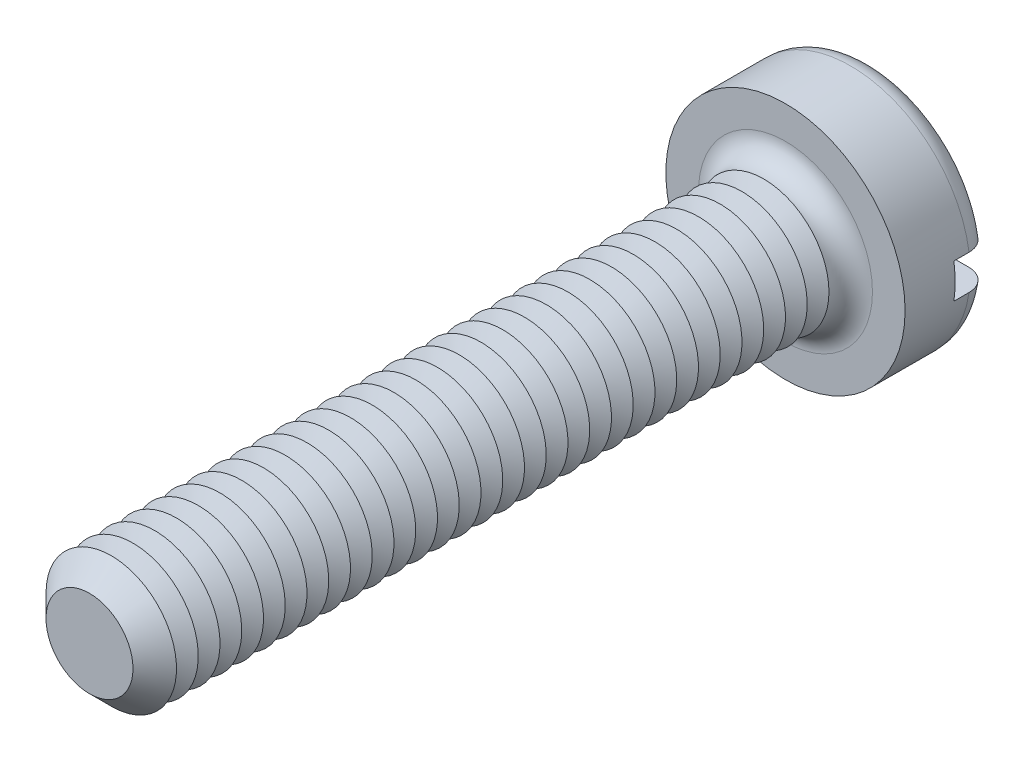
ISO-10303-21;
HEADER;
FILE_DESCRIPTION(('STEP AP214'),'2;1');
FILE_NAME('part.step','',(''),(''),'','','');
FILE_SCHEMA(('AUTOMOTIVE_DESIGN { 1 0 10303 214 1 1 1 1 }'));
ENDSEC;
DATA;
#1=APPLICATION_CONTEXT('core data for automotive mechanical design processes');
#2=APPLICATION_PROTOCOL_DEFINITION('international standard','automotive_design',2000,#1);
#3=PRODUCT_CONTEXT('',#1,'mechanical');
#4=PRODUCT('Part','Part','',(#3));
#5=PRODUCT_RELATED_PRODUCT_CATEGORY('part','',(#4));
#6=PRODUCT_DEFINITION_FORMATION('','',#4);
#7=PRODUCT_DEFINITION_CONTEXT('part definition',#1,'design');
#8=PRODUCT_DEFINITION('design','',#6,#7);
#9=PRODUCT_DEFINITION_SHAPE('','',#8);
#10=(LENGTH_UNIT() NAMED_UNIT(*) SI_UNIT(.MILLI.,.METRE.));
#11=(NAMED_UNIT(*) PLANE_ANGLE_UNIT() SI_UNIT($,.RADIAN.));
#12=(NAMED_UNIT(*) SI_UNIT($,.STERADIAN.) SOLID_ANGLE_UNIT());
#13=UNCERTAINTY_MEASURE_WITH_UNIT(LENGTH_MEASURE(1.E-05),#10,'distance_accuracy_value','');
#14=(GEOMETRIC_REPRESENTATION_CONTEXT(3) GLOBAL_UNCERTAINTY_ASSIGNED_CONTEXT((#13)) GLOBAL_UNIT_ASSIGNED_CONTEXT((#10,
#11,#12)) REPRESENTATION_CONTEXT('',''));
#15=CARTESIAN_POINT('',(0.,0.,0.));
#16=DIRECTION('',(0.,0.,1.));
#17=DIRECTION('',(1.,0.,0.));
#18=AXIS2_PLACEMENT_3D('',#15,#16,#17);
#19=CARTESIAN_POINT('',(0.,0.,-2.));
#20=DIRECTION('',(0.,0.,1.));
#21=DIRECTION('',(1.,0.,0.));
#22=AXIS2_PLACEMENT_3D('',#19,#20,#21);
#23=PLANE('',#22);
#24=CARTESIAN_POINT('',(0.,0.,-2.));
#25=DIRECTION('',(0.,0.,1.));
#26=DIRECTION('',(1.,0.,0.));
#27=AXIS2_PLACEMENT_3D('',#24,#25,#26);
#28=CIRCLE('',#27,2.25);
#29=CARTESIAN_POINT('',(-2.21415898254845,0.4,-2.));
#30=VERTEX_POINT('',#29);
#31=CARTESIAN_POINT('',(2.21415898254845,0.4,-2.));
#32=VERTEX_POINT('',#31);
#33=EDGE_CURVE('E116',#30,#32,#28,.F.);
#34=ORIENTED_EDGE('',*,*,#33,.T.);
#35=DIRECTION('',(1.,0.,0.));
#36=VECTOR('',#35,1.);
#37=CARTESIAN_POINT('',(-2.75,0.400000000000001,-2.));
#38=LINE('',#37,#36);
#39=EDGE_CURVE('E111',#30,#32,#38,.T.);
#40=ORIENTED_EDGE('',*,*,#39,.F.);
#41=EDGE_LOOP('',(#34,#40));
#42=FACE_BOUND('',#41,.T.);
#43=ADVANCED_FACE('F39',(#42),#23,.F.);
#44=CARTESIAN_POINT('',(0.,0.,-1.5));
#45=DIRECTION('',(0.,0.,1.));
#46=DIRECTION('',(1.,0.,0.));
#47=AXIS2_PLACEMENT_3D('',#44,#45,#46);
#48=TOROIDAL_SURFACE('',#47,2.25,0.5);
#49=CARTESIAN_POINT('',(-2.6296588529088,0.400000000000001,-1.78631483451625));
#50=CARTESIAN_POINT('',(-2.61332846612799,0.400000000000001,-1.80942627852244));
#51=CARTESIAN_POINT('',(-2.59501593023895,0.400000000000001,-1.83116426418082));
#52=CARTESIAN_POINT('',(-2.55497423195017,0.400000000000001,-1.87126271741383));
#53=CARTESIAN_POINT('',(-2.53324055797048,0.4,-1.88961865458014));
#54=CARTESIAN_POINT('',(-2.48702796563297,0.4,-1.92241505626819));
#55=CARTESIAN_POINT('',(-2.46255183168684,0.4,-1.93685944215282));
#56=CARTESIAN_POINT('',(-2.41154731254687,0.4,-1.96147315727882));
#57=CARTESIAN_POINT('',(-2.38501943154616,0.4,-1.97164353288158));
#58=CARTESIAN_POINT('',(-2.3303912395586,0.4,-1.98753780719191));
#59=CARTESIAN_POINT('',(-2.30227842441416,0.4,-1.99321871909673));
#60=CARTESIAN_POINT('',(-2.24549884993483,0.4,-1.99984170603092));
#61=CARTESIAN_POINT('',(-2.21683202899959,0.4,-2.00078325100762));
#62=CARTESIAN_POINT('',(-2.15939326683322,0.4,-1.99790249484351));
#63=CARTESIAN_POINT('',(-2.13062419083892,0.4,-1.99402290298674));
#64=CARTESIAN_POINT('',(-2.07413526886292,0.4,-1.98151915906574));
#65=CARTESIAN_POINT('',(-2.04641547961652,0.4,-1.97289475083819));
#66=CARTESIAN_POINT('',(-1.99264697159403,0.4,-1.95107177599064));
#67=CARTESIAN_POINT('',(-1.96660904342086,0.4,-1.93784659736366));
#68=CARTESIAN_POINT('',(-1.91713954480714,0.4,-1.90718730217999));
#69=CARTESIAN_POINT('',(-1.89370795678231,0.4,-1.88975321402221));
#70=CARTESIAN_POINT('',(-1.85029144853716,0.4,-1.85126548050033));
#71=CARTESIAN_POINT('',(-1.83028607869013,0.4,-1.83023492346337));
#72=CARTESIAN_POINT('',(-1.79417432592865,0.4,-1.78505552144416));
#73=CARTESIAN_POINT('',(-1.77806752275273,0.4,-1.76090701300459));
#74=CARTESIAN_POINT('',(-1.75056079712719,0.4,-1.71067721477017));
#75=CARTESIAN_POINT('',(-1.7390748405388,0.4,-1.68464306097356));
#76=CARTESIAN_POINT('',(-1.72075680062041,0.4,-1.63098625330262));
#77=CARTESIAN_POINT('',(-1.71392397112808,0.4,-1.60336385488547));
#78=CARTESIAN_POINT('',(-1.70525661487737,0.4,-1.54801066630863));
#79=CARTESIAN_POINT('',(-1.70330866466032,0.4,-1.52029759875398));
#80=CARTESIAN_POINT('',(-1.70414820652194,0.4,-1.46494458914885));
#81=CARTESIAN_POINT('',(-1.70693532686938,0.4,-1.43730464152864));
#82=CARTESIAN_POINT('',(-1.71709335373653,0.4,-1.38318389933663));
#83=CARTESIAN_POINT('',(-1.72441580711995,0.4,-1.35669397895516));
#84=CARTESIAN_POINT('',(-1.74335830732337,0.4,-1.30529964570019));
#85=CARTESIAN_POINT('',(-1.75497853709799,0.4,-1.2803953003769));
#86=CARTESIAN_POINT('',(-1.78229453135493,0.4,-1.23258298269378));
#87=CARTESIAN_POINT('',(-1.79803217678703,0.4,-1.20969896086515));
#88=CARTESIAN_POINT('',(-1.83304498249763,0.4,-1.16682064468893));
#89=CARTESIAN_POINT('',(-1.85232054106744,0.4,-1.1468266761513));
#90=CARTESIAN_POINT('',(-1.89433695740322,0.4,-1.10980713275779));
#91=CARTESIAN_POINT('',(-1.91714740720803,0.4,-1.09286053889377));
#92=CARTESIAN_POINT('',(-1.96524407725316,0.4,-1.06294809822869));
#93=CARTESIAN_POINT('',(-1.99053056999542,0.4,-1.04998269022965));
#94=CARTESIAN_POINT('',(-2.04340612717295,0.4,-1.02814800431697));
#95=CARTESIAN_POINT('',(-2.07103098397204,0.4,-1.01936532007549));
#96=CARTESIAN_POINT('',(-2.12735840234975,0.4,-1.00652373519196));
#97=CARTESIAN_POINT('',(-2.15606102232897,0.4,-1.00246509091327));
#98=CARTESIAN_POINT('',(-2.21395379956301,0.4,-0.999181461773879));
#99=CARTESIAN_POINT('',(-2.24314598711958,0.4,-0.999992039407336));
#100=CARTESIAN_POINT('',(-2.30097585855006,0.4,-1.00652779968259));
#101=CARTESIAN_POINT('',(-2.32961355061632,0.4,-1.01225290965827));
#102=CARTESIAN_POINT('',(-2.38536238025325,0.4,-1.02843951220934));
#103=CARTESIAN_POINT('',(-2.41248047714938,0.4,-1.03887701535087));
#104=CARTESIAN_POINT('',(-2.46454860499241,0.4,-1.06421009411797));
#105=CARTESIAN_POINT('',(-2.48949875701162,0.4,-1.0791054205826));
#106=CARTESIAN_POINT('',(-2.53620471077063,0.4,-1.11274531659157));
#107=CARTESIAN_POINT('',(-2.55799482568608,0.400000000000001,-1.1314422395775));
#108=CARTESIAN_POINT('',(-2.59807595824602,0.400000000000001,-1.17227176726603));
#109=CARTESIAN_POINT('',(-2.6163672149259,0.400000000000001,-1.19440413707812));
#110=CARTESIAN_POINT('',(-2.64868581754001,0.400000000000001,-1.24117072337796));
#111=CARTESIAN_POINT('',(-2.66276466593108,0.400000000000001,-1.26576935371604));
#112=CARTESIAN_POINT('',(-2.68654482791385,0.400000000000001,-1.31699754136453));
#113=CARTESIAN_POINT('',(-2.69624657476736,0.400000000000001,-1.34362689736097));
#114=CARTESIAN_POINT('',(-2.71090527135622,0.400000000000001,-1.39787706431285));
#115=CARTESIAN_POINT('',(-2.71590826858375,0.400000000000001,-1.4254854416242));
#116=CARTESIAN_POINT('',(-2.72118463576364,0.400000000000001,-1.48115803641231));
#117=CARTESIAN_POINT('',(-2.72145696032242,0.400000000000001,-1.50922235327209));
#118=CARTESIAN_POINT('',(-2.71727180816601,0.400000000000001,-1.56487271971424));
#119=CARTESIAN_POINT('',(-2.71283440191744,0.400000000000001,-1.59246029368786));
#120=CARTESIAN_POINT('',(-2.69939521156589,0.400000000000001,-1.64647499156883));
#121=CARTESIAN_POINT('',(-2.69039909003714,0.400000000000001,-1.67290351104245));
#122=CARTESIAN_POINT('',(-2.67251693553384,0.400000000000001,-1.71382731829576));
#123=CARTESIAN_POINT('',(-2.66497994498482,0.400000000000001,-1.72892686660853));
#124=CARTESIAN_POINT('',(-2.64841616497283,0.400000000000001,-1.75828509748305));
#125=CARTESIAN_POINT('',(-2.63938938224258,0.400000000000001,-1.77254378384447));
#126=CARTESIAN_POINT('',(-2.6296588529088,0.400000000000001,-1.78631483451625));
#127=B_SPLINE_CURVE_WITH_KNOTS('',3,(#49,#50,#51,#52,#53,#54,#55,#56,#57,#58,#59,#60,#61,#62,
#63,#64,#65,#66,#67,#68,#69,#70,#71,#72,#73,#74,#75,#76,#77,#78,#79,#80,#81,#82,#83,#84,#85,#86,
#87,#88,#89,#90,#91,#92,#93,#94,#95,#96,#97,#98,#99,#100,#101,#102,#103,#104,#105,#106,#107,
#108,#109,#110,#111,#112,#113,#114,#115,#116,#117,#118,#119,#120,#121,#122,#123,#124,#125,#126),
.UNSPECIFIED.,.T.,.F.,(4,2,2,2,2,2,2,2,2,2,2,2,2,2,2,2,2,2,2,2,2,2,2,2,2,2,2,2,2,2,2,2,2,2,2,2,
2,2,4),(0.,0.0848338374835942,0.16978050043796,0.254641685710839,0.339482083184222,
0.42512530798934,0.510778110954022,0.597458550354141,0.684143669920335,0.771338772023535,
0.858533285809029,0.945187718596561,1.03183280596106,1.11678035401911,1.20171427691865,
1.28465703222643,1.36759327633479,1.4496584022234,1.53172702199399,1.61466526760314,
1.69761285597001,1.78247103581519,1.86733856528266,1.95389396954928,2.0404540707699,
2.12764713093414,2.21483890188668,2.30159172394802,2.38833969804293,2.4740609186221,
2.55977628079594,2.6443962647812,2.72900787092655,2.81278135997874,2.89657336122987,
2.98000971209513,3.06334267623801,3.113891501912,3.16444009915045),.UNSPECIFIED.);
#128=CARTESIAN_POINT('',(-2.72075357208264,0.400000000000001,-1.50000000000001));
#129=VERTEX_POINT('',#128);
#130=EDGE_CURVE('E419',#129,#30,#127,.T.);
#131=ORIENTED_EDGE('',*,*,#130,.F.);
#132=CARTESIAN_POINT('',(0.,0.,-1.5));
#133=DIRECTION('',(0.,0.,1.));
#134=DIRECTION('',(1.,0.,0.));
#135=AXIS2_PLACEMENT_3D('',#132,#133,#134);
#136=CIRCLE('',#135,2.75);
#137=CARTESIAN_POINT('',(2.7207535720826,0.4,-1.5));
#138=VERTEX_POINT('',#137);
#139=EDGE_CURVE('E125',#138,#129,#136,.T.);
#140=ORIENTED_EDGE('',*,*,#139,.F.);
#141=CARTESIAN_POINT('',(1.7362507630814,0.4,-1.6752840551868));
#142=CARTESIAN_POINT('',(1.74636083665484,0.4,-1.70159961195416));
#143=CARTESIAN_POINT('',(1.7587429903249,0.4,-1.72706707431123));
#144=CARTESIAN_POINT('',(1.78764414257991,0.4,-1.77556609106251));
#145=CARTESIAN_POINT('',(1.80416918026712,0.4,-1.79859401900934));
#146=CARTESIAN_POINT('',(1.84080454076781,0.4,-1.84153587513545));
#147=CARTESIAN_POINT('',(1.86090949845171,0.4,-1.86145438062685));
#148=CARTESIAN_POINT('',(1.9041208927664,0.4,-1.89769607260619));
#149=CARTESIAN_POINT('',(1.92722659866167,0.4,-1.91402013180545));
#150=CARTESIAN_POINT('',(1.97620958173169,0.4,-1.94291288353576));
#151=CARTESIAN_POINT('',(2.00212726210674,0.4,-1.95541309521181));
#152=CARTESIAN_POINT('',(2.05567603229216,0.4,-1.97595143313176));
#153=CARTESIAN_POINT('',(2.08330733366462,0.4,-1.98398900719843));
#154=CARTESIAN_POINT('',(2.13989163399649,0.4,-1.99545904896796));
#155=CARTESIAN_POINT('',(2.16885726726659,0.4,-1.99882930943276));
#156=CARTESIAN_POINT('',(2.22694412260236,0.4,-2.00065872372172));
#157=CARTESIAN_POINT('',(2.25606534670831,0.4,-1.99911781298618));
#158=CARTESIAN_POINT('',(2.31362436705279,0.4,-1.99114818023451));
#159=CARTESIAN_POINT('',(2.34206235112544,0.4,-1.98472081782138));
#160=CARTESIAN_POINT('',(2.39743709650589,0.4,-1.96713601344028));
#161=CARTESIAN_POINT('',(2.42437392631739,0.4,-1.95597878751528));
#162=CARTESIAN_POINT('',(2.47569769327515,0.4,-1.92935960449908));
#163=CARTESIAN_POINT('',(2.50010686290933,0.4,-1.91394052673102));
#164=CARTESIAN_POINT('',(2.54594525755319,0.4,-1.8791725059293));
#165=CARTESIAN_POINT('',(2.56737468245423,0.4,-1.85982382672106));
#166=CARTESIAN_POINT('',(2.60634898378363,0.4,-1.81801641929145));
#167=CARTESIAN_POINT('',(2.6239407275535,0.4,-1.79560138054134));
#168=CARTESIAN_POINT('',(2.65505953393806,0.4,-1.7481077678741));
#169=CARTESIAN_POINT('',(2.66858686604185,0.4,-1.72302937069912));
#170=CARTESIAN_POINT('',(2.69103536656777,0.4,-1.67123055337));
#171=CARTESIAN_POINT('',(2.70000740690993,0.4,-1.64453217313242));
#172=CARTESIAN_POINT('',(2.71330608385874,0.4,-1.59000262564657));
#173=CARTESIAN_POINT('',(2.71763293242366,0.4,-1.5621715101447));
#174=CARTESIAN_POINT('',(2.72149675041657,0.4,-1.50637655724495));
#175=CARTESIAN_POINT('',(2.72106725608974,0.4,-1.47841503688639));
#176=CARTESIAN_POINT('',(2.7155123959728,0.4,-1.42296287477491));
#177=CARTESIAN_POINT('',(2.71038711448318,0.4,-1.39547222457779));
#178=CARTESIAN_POINT('',(2.69560462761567,0.4,-1.34178071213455));
#179=CARTESIAN_POINT('',(2.68595389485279,0.4,-1.31557806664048));
#180=CARTESIAN_POINT('',(2.66240876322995,0.4,-1.26515516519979));
#181=CARTESIAN_POINT('',(2.64851431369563,0.4,-1.24093493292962));
#182=CARTESIAN_POINT('',(2.61681930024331,0.4,-1.19504594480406));
#183=CARTESIAN_POINT('',(2.59900198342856,0.4,-1.17338876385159));
#184=CARTESIAN_POINT('',(2.56001495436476,0.4,-1.13333899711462));
#185=CARTESIAN_POINT('',(2.53884510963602,0.4,-1.11494654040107));
#186=CARTESIAN_POINT('',(2.49354554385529,0.4,-1.08175888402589));
#187=CARTESIAN_POINT('',(2.46938991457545,0.4,-1.06699905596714));
#188=CARTESIAN_POINT('',(2.41896725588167,0.4,-1.04168682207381));
#189=CARTESIAN_POINT('',(2.39270009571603,0.4,-1.03113467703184));
#190=CARTESIAN_POINT('',(2.33844927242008,0.4,-1.01439607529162));
#191=CARTESIAN_POINT('',(2.31044823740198,0.4,-1.00826592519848));
#192=CARTESIAN_POINT('',(2.25381752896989,0.4,-1.00073183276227));
#193=CARTESIAN_POINT('',(2.22518781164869,0.4,-0.999328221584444));
#194=CARTESIAN_POINT('',(2.16774231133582,0.4,-1.00127811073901));
#195=CARTESIAN_POINT('',(2.13892848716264,0.4,-1.00468955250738));
#196=CARTESIAN_POINT('',(2.08227193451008,0.4,-1.01626887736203));
#197=CARTESIAN_POINT('',(2.05442926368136,0.4,-1.02443704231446));
#198=CARTESIAN_POINT('',(2.00032604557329,0.4,-1.04537295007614));
#199=CARTESIAN_POINT('',(1.97407661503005,0.4,-1.05816944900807));
#200=CARTESIAN_POINT('',(1.92411255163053,0.4,-1.08801035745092));
#201=CARTESIAN_POINT('',(1.90039792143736,0.4,-1.10505477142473));
#202=CARTESIAN_POINT('',(1.85633574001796,0.4,-1.14282887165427));
#203=CARTESIAN_POINT('',(1.83597040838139,0.4,-1.16353779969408));
#204=CARTESIAN_POINT('',(1.79908731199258,0.4,-1.20813793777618));
#205=CARTESIAN_POINT('',(1.78256899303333,0.4,-1.23202868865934));
#206=CARTESIAN_POINT('',(1.75420022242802,0.4,-1.28183173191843));
#207=CARTESIAN_POINT('',(1.74226635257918,0.4,-1.30769648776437));
#208=CARTESIAN_POINT('',(1.72302798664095,0.4,-1.36110211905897));
#209=CARTESIAN_POINT('',(1.71572395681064,0.4,-1.38864316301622));
#210=CARTESIAN_POINT('',(1.70611974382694,0.4,-1.44392326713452));
#211=CARTESIAN_POINT('',(1.70370764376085,0.4,-1.47164298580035));
#212=CARTESIAN_POINT('',(1.70363822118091,0.4,-1.52706336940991));
#213=CARTESIAN_POINT('',(1.70597448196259,0.4,-1.55476400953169));
#214=CARTESIAN_POINT('',(1.71335146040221,0.4,-1.59796127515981));
#215=CARTESIAN_POINT('',(1.71686033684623,0.4,-1.61373520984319));
#216=CARTESIAN_POINT('',(1.7254146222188,0.4,-1.64486018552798));
#217=CARTESIAN_POINT('',(1.73045999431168,0.4,-1.66021123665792));
#218=CARTESIAN_POINT('',(1.7362507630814,0.4,-1.6752840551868));
#219=B_SPLINE_CURVE_WITH_KNOTS('',3,(#141,#142,#143,#144,#145,#146,#147,#148,#149,#150,#151,
#152,#153,#154,#155,#156,#157,#158,#159,#160,#161,#162,#163,#164,#165,#166,#167,#168,#169,#170,
#171,#172,#173,#174,#175,#176,#177,#178,#179,#180,#181,#182,#183,#184,#185,#186,#187,#188,#189,
#190,#191,#192,#193,#194,#195,#196,#197,#198,#199,#200,#201,#202,#203,#204,#205,#206,#207,#208,
#209,#210,#211,#212,#213,#214,#215,#216,#217,#218),.UNSPECIFIED.,.T.,.F.,(4,2,2,2,2,2,2,2,2,2,2,
2,2,2,2,2,2,2,2,2,2,2,2,2,2,2,2,2,2,2,2,2,2,2,2,2,2,2,4),(0.,0.0845117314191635,
0.169147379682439,0.253657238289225,0.338146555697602,0.424070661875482,0.510005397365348,
0.597074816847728,0.684145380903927,0.771191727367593,0.858234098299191,0.94443074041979,
1.03062159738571,1.11569223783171,1.20075723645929,1.28485012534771,1.36893917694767,
1.45243570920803,1.53593074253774,1.61930671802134,1.70268368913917,1.7864238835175,
1.87016738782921,1.95469664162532,2.03923113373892,2.12482389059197,2.21042264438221,
2.29706026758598,2.38370302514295,2.47089361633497,2.55808429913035,2.64479602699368,
2.73149525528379,2.81653234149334,2.9015779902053,2.98465497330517,3.06761976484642,
3.11602689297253,3.164432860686),.UNSPECIFIED.);
#220=EDGE_CURVE('E421',#32,#138,#219,.T.);
#221=ORIENTED_EDGE('',*,*,#220,.F.);
#222=ORIENTED_EDGE('',*,*,#33,.F.);
#223=EDGE_LOOP('',(#131,#140,#221,#222));
#224=FACE_BOUND('',#223,.T.);
#225=ADVANCED_FACE('F403',(#224),#48,.T.);
#226=CARTESIAN_POINT('',(0.,0.,-2.));
#227=DIRECTION('',(0.,0.,1.));
#228=DIRECTION('',(1.,0.,0.));
#229=AXIS2_PLACEMENT_3D('',#226,#227,#228);
#230=CYLINDRICAL_SURFACE('',#229,2.75);
#231=DIRECTION('',(0.,0.,1.));
#232=VECTOR('',#231,1.);
#233=CARTESIAN_POINT('',(2.72075357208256,0.4,-2.));
#234=LINE('',#233,#232);
#235=CARTESIAN_POINT('',(2.72075357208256,0.4,-1.15));
#236=VERTEX_POINT('',#235);
#237=EDGE_CURVE('E437',#138,#236,#234,.T.);
#238=ORIENTED_EDGE('',*,*,#237,.F.);
#239=ORIENTED_EDGE('',*,*,#139,.T.);
#240=DIRECTION('',(0.,0.,1.));
#241=VECTOR('',#240,1.);
#242=CARTESIAN_POINT('',(-2.72075357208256,0.4,-2.));
#243=LINE('',#242,#241);
#244=CARTESIAN_POINT('',(-2.72075357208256,0.4,-1.15));
#245=VERTEX_POINT('',#244);
#246=EDGE_CURVE('E63',#245,#129,#243,.F.);
#247=ORIENTED_EDGE('',*,*,#246,.F.);
#248=CARTESIAN_POINT('',(0.,0.,-1.15));
#249=DIRECTION('',(0.,0.,-1.));
#250=DIRECTION('',(-1.,0.,0.));
#251=AXIS2_PLACEMENT_3D('',#248,#249,#250);
#252=CIRCLE('',#251,2.75);
#253=CARTESIAN_POINT('',(-2.72075357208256,-0.4,-1.15));
#254=VERTEX_POINT('',#253);
#255=EDGE_CURVE('E43',#245,#254,#252,.F.);
#256=ORIENTED_EDGE('',*,*,#255,.T.);
#257=DIRECTION('',(0.,0.,1.));
#258=VECTOR('',#257,1.);
#259=CARTESIAN_POINT('',(-2.72075357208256,-0.4,-2.));
#260=LINE('',#259,#258);
#261=CARTESIAN_POINT('',(-2.72075357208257,-0.4,-1.5));
#262=VERTEX_POINT('',#261);
#263=EDGE_CURVE('E434',#262,#254,#260,.T.);
#264=ORIENTED_EDGE('',*,*,#263,.F.);
#265=CARTESIAN_POINT('',(2.72075357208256,-0.4,-1.5));
#266=VERTEX_POINT('',#265);
#267=EDGE_CURVE('E127',#262,#266,#136,.T.);
#268=ORIENTED_EDGE('',*,*,#267,.T.);
#269=DIRECTION('',(0.,0.,1.));
#270=VECTOR('',#269,1.);
#271=CARTESIAN_POINT('',(2.72075357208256,-0.4,-2.));
#272=LINE('',#271,#270);
#273=CARTESIAN_POINT('',(2.72075357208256,-0.4,-1.15));
#274=VERTEX_POINT('',#273);
#275=EDGE_CURVE('E55',#274,#266,#272,.F.);
#276=ORIENTED_EDGE('',*,*,#275,.F.);
#277=EDGE_CURVE('E11',#274,#236,#252,.F.);
#278=ORIENTED_EDGE('',*,*,#277,.T.);
#279=EDGE_LOOP('',(#238,#239,#247,#256,#264,#268,#276,#278));
#280=FACE_BOUND('',#279,.T.);
#281=CARTESIAN_POINT('',(0.,0.,0.));
#282=DIRECTION('',(0.,0.,1.));
#283=DIRECTION('',(1.,0.,0.));
#284=AXIS2_PLACEMENT_3D('',#281,#282,#283);
#285=CIRCLE('',#284,2.75);
#286=CARTESIAN_POINT('',(2.75,0.,0.));
#287=VERTEX_POINT('',#286);
#288=EDGE_CURVE('E440',#287,#287,#285,.T.);
#289=ORIENTED_EDGE('',*,*,#288,.F.);
#290=EDGE_LOOP('',(#289));
#291=FACE_BOUND('',#290,.T.);
#292=ADVANCED_FACE('F399',(#280,#291),#230,.T.);
#293=CARTESIAN_POINT('',(2.21415898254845,-0.4,-2.));
#294=VERTEX_POINT('',#293);
#295=CARTESIAN_POINT('',(-2.21415898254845,-0.4,-2.));
#296=VERTEX_POINT('',#295);
#297=EDGE_CURVE('E109',#294,#296,#28,.F.);
#298=ORIENTED_EDGE('',*,*,#297,.T.);
#299=DIRECTION('',(-1.,0.,0.));
#300=VECTOR('',#299,1.);
#301=CARTESIAN_POINT('',(-2.75,-0.4,-2.));
#302=LINE('',#301,#300);
#303=EDGE_CURVE('E96',#294,#296,#302,.T.);
#304=ORIENTED_EDGE('',*,*,#303,.F.);
#305=EDGE_LOOP('',(#298,#304));
#306=FACE_BOUND('',#305,.T.);
#307=ADVANCED_FACE('F108',(#306),#23,.F.);
#308=CARTESIAN_POINT('',(0.,0.,0.));
#309=DIRECTION('',(0.,0.,1.));
#310=DIRECTION('',(1.,0.,0.));
#311=AXIS2_PLACEMENT_3D('',#308,#309,#310);
#312=PLANE('',#311);
#313=CARTESIAN_POINT('',(0.,0.,0.));
#314=DIRECTION('',(0.,0.,1.));
#315=DIRECTION('',(1.,0.,0.));
#316=AXIS2_PLACEMENT_3D('',#313,#314,#315);
#317=CIRCLE('',#316,2.);
#318=CARTESIAN_POINT('',(2.,0.,0.));
#319=VERTEX_POINT('',#318);
#320=EDGE_CURVE('E115',#319,#319,#317,.F.);
#321=ORIENTED_EDGE('',*,*,#320,.T.);
#322=EDGE_LOOP('',(#321));
#323=FACE_BOUND('',#322,.T.);
#324=ORIENTED_EDGE('',*,*,#288,.T.);
#325=EDGE_LOOP('',(#324));
#326=FACE_BOUND('',#325,.T.);
#327=ADVANCED_FACE('F398',(#323,#326),#312,.T.);
#328=CARTESIAN_POINT('',(-2.6296588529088,-0.4,-1.78631483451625));
#329=CARTESIAN_POINT('',(-2.64575286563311,-0.4,-1.76353353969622));
#330=CARTESIAN_POINT('',(-2.65994473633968,-0.4,-1.73938506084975));
#331=CARTESIAN_POINT('',(-2.68408879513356,-0.4,-1.68903091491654));
#332=CARTESIAN_POINT('',(-2.69403633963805,-0.4,-1.6628230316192));
#333=CARTESIAN_POINT('',(-2.70937899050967,-0.4,-1.60911025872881));
#334=CARTESIAN_POINT('',(-2.71477511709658,-0.4,-1.5816056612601));
#335=CARTESIAN_POINT('',(-2.72085365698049,-0.4,-1.52608718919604));
#336=CARTESIAN_POINT('',(-2.7215371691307,-0.4,-1.49807343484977));
#337=CARTESIAN_POINT('',(-2.71817903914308,-0.4,-1.44242333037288));
#338=CARTESIAN_POINT('',(-2.71415291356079,-0.4,-1.41478604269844));
#339=CARTESIAN_POINT('',(-2.70152104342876,-0.4,-1.36057835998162));
#340=CARTESIAN_POINT('',(-2.69291517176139,-0.4,-1.33400799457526));
#341=CARTESIAN_POINT('',(-2.67137052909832,-0.4,-1.28266198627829));
#342=CARTESIAN_POINT('',(-2.65842829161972,-0.4,-1.25788779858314));
#343=CARTESIAN_POINT('',(-2.62859348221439,-0.4,-1.21084577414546));
#344=CARTESIAN_POINT('',(-2.61170082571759,-0.4,-1.18857799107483));
#345=CARTESIAN_POINT('',(-2.5743351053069,-0.4,-1.1470221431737));
#346=CARTESIAN_POINT('',(-2.55383974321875,-0.4,-1.12775413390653));
#347=CARTESIAN_POINT('',(-2.5099353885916,-0.4,-1.09288845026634));
#348=CARTESIAN_POINT('',(-2.48652625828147,-0.4,-1.07729094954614));
#349=CARTESIAN_POINT('',(-2.43718903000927,-0.4,-1.0500239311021));
#350=CARTESIAN_POINT('',(-2.41123629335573,-0.4,-1.0383990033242));
#351=CARTESIAN_POINT('',(-2.35776417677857,-0.4,-1.01960886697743));
#352=CARTESIAN_POINT('',(-2.33024469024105,-0.4,-1.01244396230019));
#353=CARTESIAN_POINT('',(-2.27404134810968,-0.4,-1.00268156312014));
#354=CARTESIAN_POINT('',(-2.24534705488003,-0.4,-1.00014414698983));
#355=CARTESIAN_POINT('',(-2.18793513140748,-0.4,-0.999867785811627));
#356=CARTESIAN_POINT('',(-2.15921749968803,-0.4,-1.00212917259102));
#357=CARTESIAN_POINT('',(-2.10225052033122,-0.4,-1.01142552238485));
#358=CARTESIAN_POINT('',(-2.07400941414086,-0.4,-1.01851105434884));
#359=CARTESIAN_POINT('',(-2.01911044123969,-0.4,-1.03730994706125));
#360=CARTESIAN_POINT('',(-1.99245264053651,-0.4,-1.04902350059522));
#361=CARTESIAN_POINT('',(-1.94142108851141,-0.4,-1.07679847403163));
#362=CARTESIAN_POINT('',(-1.91705303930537,-0.4,-1.09287038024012));
#363=CARTESIAN_POINT('',(-1.87139758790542,-0.4,-1.12891897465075));
#364=CARTESIAN_POINT('',(-1.85011007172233,-0.4,-1.14889551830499));
#365=CARTESIAN_POINT('',(-1.81149058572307,-0.4,-1.19196940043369));
#366=CARTESIAN_POINT('',(-1.79411779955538,-0.4,-1.21503011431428));
#367=CARTESIAN_POINT('',(-1.76359546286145,-0.4,-1.26379588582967));
#368=CARTESIAN_POINT('',(-1.75044532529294,-0.4,-1.28950057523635));
#369=CARTESIAN_POINT('',(-1.72906221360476,-0.4,-1.3422057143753));
#370=CARTESIAN_POINT('',(-1.72072512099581,-0.4,-1.3691639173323));
#371=CARTESIAN_POINT('',(-1.70880448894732,-0.4,-1.42411084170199));
#372=CARTESIAN_POINT('',(-1.7052202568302,-0.4,-1.45209941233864));
#373=CARTESIAN_POINT('',(-1.70295553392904,-0.4,-1.50768522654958));
#374=CARTESIAN_POINT('',(-1.70417398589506,-0.4,-1.53527840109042));
#375=CARTESIAN_POINT('',(-1.71124536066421,-0.4,-1.58986292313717));
#376=CARTESIAN_POINT('',(-1.71709811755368,-0.4,-1.61685429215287));
#377=CARTESIAN_POINT('',(-1.73321132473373,-0.4,-1.66938107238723));
#378=CARTESIAN_POINT('',(-1.74345625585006,-0.4,-1.69492125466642));
#379=CARTESIAN_POINT('',(-1.76802111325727,-0.4,-1.74395877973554));
#380=CARTESIAN_POINT('',(-1.78234133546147,-0.4,-1.76745597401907));
#381=CARTESIAN_POINT('',(-1.81488631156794,-0.4,-1.81216193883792));
#382=CARTESIAN_POINT('',(-1.83317116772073,-0.4,-1.83332693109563));
#383=CARTESIAN_POINT('',(-1.87296030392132,-0.4,-1.872375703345));
#384=CARTESIAN_POINT('',(-1.89446497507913,-0.4,-1.89025908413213));
#385=CARTESIAN_POINT('',(-1.94063077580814,-0.4,-1.92267732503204));
#386=CARTESIAN_POINT('',(-1.96535444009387,-0.4,-1.93712316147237));
#387=CARTESIAN_POINT('',(-2.01684705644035,-0.4,-1.96173690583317));
#388=CARTESIAN_POINT('',(-2.04361620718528,-0.4,-1.97190439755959));
#389=CARTESIAN_POINT('',(-2.09891021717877,-0.4,-1.9878230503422));
#390=CARTESIAN_POINT('',(-2.12745653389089,-0.4,-1.99349978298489));
#391=CARTESIAN_POINT('',(-2.18509639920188,-0.4,-1.99999556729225));
#392=CARTESIAN_POINT('',(-2.21418994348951,-0.4,-2.00081465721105));
#393=CARTESIAN_POINT('',(-2.27218032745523,-0.4,-1.99755156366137));
#394=CARTESIAN_POINT('',(-2.30107643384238,-0.4,-1.99345627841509));
#395=CARTESIAN_POINT('',(-2.35776697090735,-0.4,-1.98043125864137));
#396=CARTESIAN_POINT('',(-2.38556116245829,-0.4,-1.97150048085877));
#397=CARTESIAN_POINT('',(-2.43901832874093,-0.4,-1.94912081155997));
#398=CARTESIAN_POINT('',(-2.46469578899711,-0.4,-1.93570648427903));
#399=CARTESIAN_POINT('',(-2.51337022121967,-0.4,-1.90471183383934));
#400=CARTESIAN_POINT('',(-2.53637056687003,-0.4,-1.88713684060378));
#401=CARTESIAN_POINT('',(-2.57111030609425,-0.4,-1.85552084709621));
#402=CARTESIAN_POINT('',(-2.58386709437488,-0.4,-1.84257896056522));
#403=CARTESIAN_POINT('',(-2.60790410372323,-0.4,-1.81538935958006));
#404=CARTESIAN_POINT('',(-2.61918433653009,-0.4,-1.80114165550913));
#405=CARTESIAN_POINT('',(-2.6296588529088,-0.4,-1.78631483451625));
#406=B_SPLINE_CURVE_WITH_KNOTS('',3,(#328,#329,#330,#331,#332,#333,#334,#335,#336,#337,#338,
#339,#340,#341,#342,#343,#344,#345,#346,#347,#348,#349,#350,#351,#352,#353,#354,#355,#356,#357,
#358,#359,#360,#361,#362,#363,#364,#365,#366,#367,#368,#369,#370,#371,#372,#373,#374,#375,#376,
#377,#378,#379,#380,#381,#382,#383,#384,#385,#386,#387,#388,#389,#390,#391,#392,#393,#394,#395,
#396,#397,#398,#399,#400,#401,#402,#403,#404,#405),.UNSPECIFIED.,.T.,.F.,(4,2,2,2,2,2,2,2,2,2,2,
2,2,2,2,2,2,2,2,2,2,2,2,2,2,2,2,2,2,2,2,2,2,2,2,2,2,2,4),(0.,0.0836125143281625,
0.167316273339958,0.251001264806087,0.334666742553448,0.418057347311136,0.501450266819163,
0.584910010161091,0.668371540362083,0.752369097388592,0.836370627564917,0.921286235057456,
1.00620762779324,1.09222390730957,1.17824613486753,1.26518425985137,1.35212600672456,
1.43927882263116,1.52642841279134,1.61262232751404,1.69880425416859,1.7830443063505,
1.86727208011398,1.9497371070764,2.03219918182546,2.1143722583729,2.19655130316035,
2.28007615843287,2.36361116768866,2.44911836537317,2.53463387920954,2.62153862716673,
2.70844269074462,2.79557895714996,2.88273403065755,2.96923214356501,3.05562004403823,
3.11003826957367,3.16445606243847),.UNSPECIFIED.);
#407=EDGE_CURVE('E103',#296,#262,#406,.T.);
#408=ORIENTED_EDGE('',*,*,#407,.F.);
#409=ORIENTED_EDGE('',*,*,#297,.F.);
#410=CARTESIAN_POINT('',(1.7362507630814,-0.4,-1.6752840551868));
#411=CARTESIAN_POINT('',(1.72641416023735,-0.4,-1.64967314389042));
#412=CARTESIAN_POINT('',(1.71871480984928,-0.4,-1.62322216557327));
#413=CARTESIAN_POINT('',(1.70786038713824,-0.4,-1.56938399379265));
#414=CARTESIAN_POINT('',(1.70470970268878,-0.4,-1.54199592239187));
#415=CARTESIAN_POINT('',(1.70306971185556,-0.4,-1.48708393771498));
#416=CARTESIAN_POINT('',(1.70457942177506,-0.4,-1.45956005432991));
#417=CARTESIAN_POINT('',(1.71220670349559,-0.4,-1.40516538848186));
#418=CARTESIAN_POINT('',(1.71832341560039,-0.4,-1.3782944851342));
#419=CARTESIAN_POINT('',(1.73494792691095,-0.4,-1.32598312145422));
#420=CARTESIAN_POINT('',(1.74545076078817,-0.4,-1.30054108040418));
#421=CARTESIAN_POINT('',(1.77051013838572,-0.4,-1.25173932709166));
#422=CARTESIAN_POINT('',(1.7850670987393,-0.4,-1.22837982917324));
#423=CARTESIAN_POINT('',(1.81806903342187,-0.4,-1.1839775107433));
#424=CARTESIAN_POINT('',(1.8365752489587,-0.4,-1.16298023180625));
#425=CARTESIAN_POINT('',(1.87677669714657,-0.4,-1.1243010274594));
#426=CARTESIAN_POINT('',(1.89847230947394,-0.4,-1.10661949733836));
#427=CARTESIAN_POINT('',(1.94498854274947,-0.4,-1.07463966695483));
#428=CARTESIAN_POINT('',(1.96987078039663,-0.4,-1.06043095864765));
#429=CARTESIAN_POINT('',(2.02163980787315,-0.4,-1.0363161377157));
#430=CARTESIAN_POINT('',(2.04852678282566,-0.4,-1.02641042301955));
#431=CARTESIAN_POINT('',(2.10400319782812,-0.4,-1.01104128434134));
#432=CARTESIAN_POINT('',(2.13261287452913,-0.4,-1.00565079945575));
#433=CARTESIAN_POINT('',(2.19033179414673,-0.4,-0.999735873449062));
#434=CARTESIAN_POINT('',(2.2194410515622,-0.4,-0.999211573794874));
#435=CARTESIAN_POINT('',(2.27740442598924,-0.4,-1.00306591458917));
#436=CARTESIAN_POINT('',(2.30625777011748,-0.4,-1.00745623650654));
#437=CARTESIAN_POINT('',(2.36280530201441,-0.4,-1.02105937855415));
#438=CARTESIAN_POINT('',(2.39049952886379,-0.4,-1.03027203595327));
#439=CARTESIAN_POINT('',(2.44369359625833,-0.4,-1.05318710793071));
#440=CARTESIAN_POINT('',(2.46920965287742,-0.4,-1.0668518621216));
#441=CARTESIAN_POINT('',(2.51754507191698,-0.4,-1.09832423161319));
#442=CARTESIAN_POINT('',(2.54036461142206,-0.4,-1.11613157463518));
#443=CARTESIAN_POINT('',(2.58234752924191,-0.4,-1.15513986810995));
#444=CARTESIAN_POINT('',(2.601553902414,-0.4,-1.1762945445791));
#445=CARTESIAN_POINT('',(2.63609001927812,-0.4,-1.22156192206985));
#446=CARTESIAN_POINT('',(2.65142002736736,-0.4,-1.24567442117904));
#447=CARTESIAN_POINT('',(2.67757733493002,-0.4,-1.29585881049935));
#448=CARTESIAN_POINT('',(2.68845668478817,-0.4,-1.32190357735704));
#449=CARTESIAN_POINT('',(2.7056478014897,-0.4,-1.375459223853));
#450=CARTESIAN_POINT('',(2.71195980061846,-0.4,-1.40297002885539));
#451=CARTESIAN_POINT('',(2.71979288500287,-0.4,-1.45843707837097));
#452=CARTESIAN_POINT('',(2.72135241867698,-0.4,-1.48638789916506));
#453=CARTESIAN_POINT('',(2.71974298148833,-0.4,-1.54215266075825));
#454=CARTESIAN_POINT('',(2.71657412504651,-0.4,-1.56996660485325));
#455=CARTESIAN_POINT('',(2.70561779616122,-0.4,-1.62459191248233));
#456=CARTESIAN_POINT('',(2.69784258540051,-0.4,-1.65140573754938));
#457=CARTESIAN_POINT('',(2.6779146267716,-0.4,-1.70335337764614));
#458=CARTESIAN_POINT('',(2.66576185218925,-0.4,-1.72848718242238));
#459=CARTESIAN_POINT('',(2.63739107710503,-0.4,-1.77645196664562));
#460=CARTESIAN_POINT('',(2.62116029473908,-0.4,-1.79927538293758));
#461=CARTESIAN_POINT('',(2.58512700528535,-0.4,-1.84190182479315));
#462=CARTESIAN_POINT('',(2.56532438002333,-0.4,-1.86170475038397));
#463=CARTESIAN_POINT('',(2.522535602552,-0.4,-1.89791219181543));
#464=CARTESIAN_POINT('',(2.49952399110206,-0.4,-1.91428661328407));
#465=CARTESIAN_POINT('',(2.45110500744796,-0.4,-1.94299324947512));
#466=CARTESIAN_POINT('',(2.4256974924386,-0.4,-1.95532522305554));
#467=CARTESIAN_POINT('',(2.37288090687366,-0.4,-1.97575769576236));
#468=CARTESIAN_POINT('',(2.34545135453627,-0.4,-1.98380524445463));
#469=CARTESIAN_POINT('',(2.28963821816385,-0.4,-1.99524443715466));
#470=CARTESIAN_POINT('',(2.26125456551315,-0.4,-1.99863574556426));
#471=CARTESIAN_POINT('',(2.20395671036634,-0.4,-2.00070487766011));
#472=CARTESIAN_POINT('',(2.17504033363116,-0.4,-1.99932265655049));
#473=CARTESIAN_POINT('',(2.11784130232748,-0.4,-1.9917648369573));
#474=CARTESIAN_POINT('',(2.08955866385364,-0.4,-1.98558911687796));
#475=CARTESIAN_POINT('',(2.03419451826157,-0.4,-1.96854979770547));
#476=CARTESIAN_POINT('',(2.00712437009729,-0.4,-1.95764925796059));
#477=CARTESIAN_POINT('',(1.95519572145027,-0.4,-1.93144413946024));
#478=CARTESIAN_POINT('',(1.93033780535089,-0.4,-1.91613840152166));
#479=CARTESIAN_POINT('',(1.88362525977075,-0.4,-1.88157419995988));
#480=CARTESIAN_POINT('',(1.86176428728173,-0.4,-1.86232430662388));
#481=CARTESIAN_POINT('',(1.82167218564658,-0.4,-1.82038600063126));
#482=CARTESIAN_POINT('',(1.803436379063,-0.4,-1.7977020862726));
#483=CARTESIAN_POINT('',(1.77700088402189,-0.4,-1.7582526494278));
#484=CARTESIAN_POINT('',(1.7675549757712,-0.4,-1.74230781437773));
#485=CARTESIAN_POINT('',(1.75049861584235,-0.4,-1.70946415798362));
#486=CARTESIAN_POINT('',(1.7428881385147,-0.4,-1.69256534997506));
#487=CARTESIAN_POINT('',(1.7362507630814,-0.4,-1.6752840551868));
#488=B_SPLINE_CURVE_WITH_KNOTS('',3,(#410,#411,#412,#413,#414,#415,#416,#417,#418,#419,#420,
#421,#422,#423,#424,#425,#426,#427,#428,#429,#430,#431,#432,#433,#434,#435,#436,#437,#438,#439,
#440,#441,#442,#443,#444,#445,#446,#447,#448,#449,#450,#451,#452,#453,#454,#455,#456,#457,#458,
#459,#460,#461,#462,#463,#464,#465,#466,#467,#468,#469,#470,#471,#472,#473,#474,#475,#476,#477,
#478,#479,#480,#481,#482,#483,#484,#485,#486,#487),.UNSPECIFIED.,.T.,.F.,(4,2,2,2,2,2,2,2,2,2,2,
2,2,2,2,2,2,2,2,2,2,2,2,2,2,2,2,2,2,2,2,2,2,2,2,2,2,2,4),(0.,0.0822382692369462,
0.164555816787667,0.246855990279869,0.329140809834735,0.411332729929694,0.493533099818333,
0.577115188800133,0.660707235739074,0.746270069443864,0.831840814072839,0.918768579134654,
1.00569887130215,1.09283622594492,1.17997064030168,1.26638632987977,1.35279634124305,
1.43810213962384,1.52340211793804,1.60767384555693,1.69194128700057,1.77552515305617,
1.85910699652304,1.94246734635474,2.02582820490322,2.10945367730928,2.19308191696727,
2.2774160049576,2.36175512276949,2.4471137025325,2.53247843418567,2.61892083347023,
2.70536542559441,2.79249842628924,2.87965437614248,2.96662291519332,3.05347850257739,
3.10897061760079,3.16446195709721),.UNSPECIFIED.);
#489=EDGE_CURVE('E92',#266,#294,#488,.T.);
#490=ORIENTED_EDGE('',*,*,#489,.F.);
#491=ORIENTED_EDGE('',*,*,#267,.F.);
#492=EDGE_LOOP('',(#408,#409,#490,#491));
#493=FACE_BOUND('',#492,.T.);
#494=ADVANCED_FACE('F113',(#493),#48,.T.);
#495=CARTESIAN_POINT('',(0.,0.,0.5));
#496=DIRECTION('',(0.,0.,1.));
#497=DIRECTION('',(1.,0.,0.));
#498=AXIS2_PLACEMENT_3D('',#495,#496,#497);
#499=TOROIDAL_SURFACE('',#498,2.,0.5);
#500=ORIENTED_EDGE('',*,*,#320,.F.);
#501=EDGE_LOOP('',(#500));
#502=FACE_BOUND('',#501,.T.);
#503=CARTESIAN_POINT('',(0.,0.,0.5));
#504=DIRECTION('',(0.,0.,-1.));
#505=DIRECTION('',(-1.,0.,0.));
#506=AXIS2_PLACEMENT_3D('',#503,#504,#505);
#507=CIRCLE('',#506,1.5);
#508=CARTESIAN_POINT('',(-1.5,0.,0.5));
#509=VERTEX_POINT('',#508);
#510=EDGE_CURVE('E445',#509,#509,#507,.T.);
#511=ORIENTED_EDGE('',*,*,#510,.T.);
#512=EDGE_LOOP('',(#511));
#513=FACE_BOUND('',#512,.T.);
#514=ADVANCED_FACE('F391',(#502,#513),#499,.F.);
#515=CARTESIAN_POINT('',(0.,0.,0.750000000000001));
#516=DIRECTION('',(0.,0.,-1.));
#517=DIRECTION('',(-1.,0.,0.));
#518=AXIS2_PLACEMENT_3D('',#515,#516,#517);
#519=CONICAL_SURFACE('',#518,1.06698729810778,1.0471975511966);
#520=ORIENTED_EDGE('',*,*,#510,.F.);
#521=EDGE_LOOP('',(#520));
#522=FACE_BOUND('',#521,.T.);
#523=CARTESIAN_POINT('',(0.,0.,0.750000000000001));
#524=DIRECTION('',(0.,0.,-1.));
#525=DIRECTION('',(-1.,0.,0.));
#526=AXIS2_PLACEMENT_3D('',#523,#524,#525);
#527=CIRCLE('',#526,1.06698729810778);
#528=CARTESIAN_POINT('',(-1.06698729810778,0.,0.750000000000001));
#529=VERTEX_POINT('',#528);
#530=EDGE_CURVE('E452',#529,#529,#527,.T.);
#531=ORIENTED_EDGE('',*,*,#530,.T.);
#532=EDGE_LOOP('',(#531));
#533=FACE_BOUND('',#532,.T.);
#534=ADVANCED_FACE('F387',(#522,#533),#519,.T.);
#535=CARTESIAN_POINT('',(0.,0.,1.));
#536=DIRECTION('',(0.,0.,1.));
#537=DIRECTION('',(1.,0.,0.));
#538=AXIS2_PLACEMENT_3D('',#535,#536,#537);
#539=CONICAL_SURFACE('',#538,1.5,1.0471975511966);
#540=ORIENTED_EDGE('',*,*,#530,.F.);
#541=EDGE_LOOP('',(#540));
#542=FACE_BOUND('',#541,.T.);
#543=CARTESIAN_POINT('',(0.,0.,1.));
#544=DIRECTION('',(0.,0.,-1.));
#545=DIRECTION('',(-1.,0.,0.));
#546=AXIS2_PLACEMENT_3D('',#543,#544,#545);
#547=CIRCLE('',#546,1.5);
#548=CARTESIAN_POINT('',(-1.5,0.,1.));
#549=VERTEX_POINT('',#548);
#550=EDGE_CURVE('E458',#549,#549,#547,.T.);
#551=ORIENTED_EDGE('',*,*,#550,.T.);
#552=EDGE_LOOP('',(#551));
#553=FACE_BOUND('',#552,.T.);
#554=ADVANCED_FACE('F383',(#542,#553),#539,.T.);
#555=CARTESIAN_POINT('',(0.,0.,1.25));
#556=DIRECTION('',(0.,0.,-1.));
#557=DIRECTION('',(-1.,0.,0.));
#558=AXIS2_PLACEMENT_3D('',#555,#556,#557);
#559=CONICAL_SURFACE('',#558,1.06698729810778,1.0471975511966);
#560=ORIENTED_EDGE('',*,*,#550,.F.);
#561=EDGE_LOOP('',(#560));
#562=FACE_BOUND('',#561,.T.);
#563=CARTESIAN_POINT('',(0.,0.,1.25));
#564=DIRECTION('',(0.,0.,-1.));
#565=DIRECTION('',(-1.,0.,0.));
#566=AXIS2_PLACEMENT_3D('',#563,#564,#565);
#567=CIRCLE('',#566,1.06698729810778);
#568=CARTESIAN_POINT('',(-1.06698729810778,0.,1.25));
#569=VERTEX_POINT('',#568);
#570=EDGE_CURVE('E462',#569,#569,#567,.T.);
#571=ORIENTED_EDGE('',*,*,#570,.T.);
#572=EDGE_LOOP('',(#571));
#573=FACE_BOUND('',#572,.T.);
#574=ADVANCED_FACE('F379',(#562,#573),#559,.T.);
#575=CARTESIAN_POINT('',(0.,0.,1.5));
#576=DIRECTION('',(0.,0.,1.));
#577=DIRECTION('',(1.,0.,0.));
#578=AXIS2_PLACEMENT_3D('',#575,#576,#577);
#579=CONICAL_SURFACE('',#578,1.5,1.0471975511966);
#580=ORIENTED_EDGE('',*,*,#570,.F.);
#581=EDGE_LOOP('',(#580));
#582=FACE_BOUND('',#581,.T.);
#583=CARTESIAN_POINT('',(0.,0.,1.5));
#584=DIRECTION('',(0.,0.,-1.));
#585=DIRECTION('',(-1.,0.,0.));
#586=AXIS2_PLACEMENT_3D('',#583,#584,#585);
#587=CIRCLE('',#586,1.5);
#588=CARTESIAN_POINT('',(-1.5,0.,1.5));
#589=VERTEX_POINT('',#588);
#590=EDGE_CURVE('E466',#589,#589,#587,.T.);
#591=ORIENTED_EDGE('',*,*,#590,.T.);
#592=EDGE_LOOP('',(#591));
#593=FACE_BOUND('',#592,.T.);
#594=ADVANCED_FACE('F375',(#582,#593),#579,.T.);
#595=CARTESIAN_POINT('',(0.,0.,1.75));
#596=DIRECTION('',(0.,0.,-1.));
#597=DIRECTION('',(-1.,0.,0.));
#598=AXIS2_PLACEMENT_3D('',#595,#596,#597);
#599=CONICAL_SURFACE('',#598,1.06698729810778,1.0471975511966);
#600=ORIENTED_EDGE('',*,*,#590,.F.);
#601=EDGE_LOOP('',(#600));
#602=FACE_BOUND('',#601,.T.);
#603=CARTESIAN_POINT('',(0.,0.,1.75));
#604=DIRECTION('',(0.,0.,-1.));
#605=DIRECTION('',(-1.,0.,0.));
#606=AXIS2_PLACEMENT_3D('',#603,#604,#605);
#607=CIRCLE('',#606,1.06698729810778);
#608=CARTESIAN_POINT('',(-1.06698729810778,0.,1.75));
#609=VERTEX_POINT('',#608);
#610=EDGE_CURVE('E470',#609,#609,#607,.T.);
#611=ORIENTED_EDGE('',*,*,#610,.T.);
#612=EDGE_LOOP('',(#611));
#613=FACE_BOUND('',#612,.T.);
#614=ADVANCED_FACE('F371',(#602,#613),#599,.T.);
#615=CARTESIAN_POINT('',(0.,0.,2.));
#616=DIRECTION('',(0.,0.,1.));
#617=DIRECTION('',(1.,0.,0.));
#618=AXIS2_PLACEMENT_3D('',#615,#616,#617);
#619=CONICAL_SURFACE('',#618,1.5,1.0471975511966);
#620=ORIENTED_EDGE('',*,*,#610,.F.);
#621=EDGE_LOOP('',(#620));
#622=FACE_BOUND('',#621,.T.);
#623=CARTESIAN_POINT('',(0.,0.,2.));
#624=DIRECTION('',(0.,0.,-1.));
#625=DIRECTION('',(-1.,0.,0.));
#626=AXIS2_PLACEMENT_3D('',#623,#624,#625);
#627=CIRCLE('',#626,1.5);
#628=CARTESIAN_POINT('',(-1.5,0.,2.));
#629=VERTEX_POINT('',#628);
#630=EDGE_CURVE('E474',#629,#629,#627,.T.);
#631=ORIENTED_EDGE('',*,*,#630,.T.);
#632=EDGE_LOOP('',(#631));
#633=FACE_BOUND('',#632,.T.);
#634=ADVANCED_FACE('F367',(#622,#633),#619,.T.);
#635=CARTESIAN_POINT('',(0.,0.,2.25));
#636=DIRECTION('',(0.,0.,-1.));
#637=DIRECTION('',(-1.,0.,0.));
#638=AXIS2_PLACEMENT_3D('',#635,#636,#637);
#639=CONICAL_SURFACE('',#638,1.06698729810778,1.0471975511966);
#640=ORIENTED_EDGE('',*,*,#630,.F.);
#641=EDGE_LOOP('',(#640));
#642=FACE_BOUND('',#641,.T.);
#643=CARTESIAN_POINT('',(0.,0.,2.25));
#644=DIRECTION('',(0.,0.,-1.));
#645=DIRECTION('',(-1.,0.,0.));
#646=AXIS2_PLACEMENT_3D('',#643,#644,#645);
#647=CIRCLE('',#646,1.06698729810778);
#648=CARTESIAN_POINT('',(-1.06698729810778,0.,2.25));
#649=VERTEX_POINT('',#648);
#650=EDGE_CURVE('E477',#649,#649,#647,.T.);
#651=ORIENTED_EDGE('',*,*,#650,.T.);
#652=EDGE_LOOP('',(#651));
#653=FACE_BOUND('',#652,.T.);
#654=ADVANCED_FACE('F363',(#642,#653),#639,.T.);
#655=CARTESIAN_POINT('',(0.,0.,2.5));
#656=DIRECTION('',(0.,0.,1.));
#657=DIRECTION('',(1.,0.,0.));
#658=AXIS2_PLACEMENT_3D('',#655,#656,#657);
#659=CONICAL_SURFACE('',#658,1.5,1.0471975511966);
#660=ORIENTED_EDGE('',*,*,#650,.F.);
#661=EDGE_LOOP('',(#660));
#662=FACE_BOUND('',#661,.T.);
#663=CARTESIAN_POINT('',(0.,0.,2.5));
#664=DIRECTION('',(0.,0.,-1.));
#665=DIRECTION('',(-1.,0.,0.));
#666=AXIS2_PLACEMENT_3D('',#663,#664,#665);
#667=CIRCLE('',#666,1.5);
#668=CARTESIAN_POINT('',(-1.5,0.,2.5));
#669=VERTEX_POINT('',#668);
#670=EDGE_CURVE('E481',#669,#669,#667,.T.);
#671=ORIENTED_EDGE('',*,*,#670,.T.);
#672=EDGE_LOOP('',(#671));
#673=FACE_BOUND('',#672,.T.);
#674=ADVANCED_FACE('F359',(#662,#673),#659,.T.);
#675=CARTESIAN_POINT('',(0.,0.,2.75));
#676=DIRECTION('',(0.,0.,-1.));
#677=DIRECTION('',(-1.,0.,0.));
#678=AXIS2_PLACEMENT_3D('',#675,#676,#677);
#679=CONICAL_SURFACE('',#678,1.06698729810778,1.0471975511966);
#680=ORIENTED_EDGE('',*,*,#670,.F.);
#681=EDGE_LOOP('',(#680));
#682=FACE_BOUND('',#681,.T.);
#683=CARTESIAN_POINT('',(0.,0.,2.75));
#684=DIRECTION('',(0.,0.,-1.));
#685=DIRECTION('',(-1.,0.,0.));
#686=AXIS2_PLACEMENT_3D('',#683,#684,#685);
#687=CIRCLE('',#686,1.06698729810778);
#688=CARTESIAN_POINT('',(-1.06698729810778,0.,2.75));
#689=VERTEX_POINT('',#688);
#690=EDGE_CURVE('E485',#689,#689,#687,.T.);
#691=ORIENTED_EDGE('',*,*,#690,.T.);
#692=EDGE_LOOP('',(#691));
#693=FACE_BOUND('',#692,.T.);
#694=ADVANCED_FACE('F355',(#682,#693),#679,.T.);
#695=CARTESIAN_POINT('',(0.,0.,3.));
#696=DIRECTION('',(0.,0.,1.));
#697=DIRECTION('',(1.,0.,0.));
#698=AXIS2_PLACEMENT_3D('',#695,#696,#697);
#699=CONICAL_SURFACE('',#698,1.5,1.0471975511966);
#700=ORIENTED_EDGE('',*,*,#690,.F.);
#701=EDGE_LOOP('',(#700));
#702=FACE_BOUND('',#701,.T.);
#703=CARTESIAN_POINT('',(0.,0.,3.));
#704=DIRECTION('',(0.,0.,-1.));
#705=DIRECTION('',(-1.,0.,0.));
#706=AXIS2_PLACEMENT_3D('',#703,#704,#705);
#707=CIRCLE('',#706,1.5);
#708=CARTESIAN_POINT('',(-1.5,0.,3.));
#709=VERTEX_POINT('',#708);
#710=EDGE_CURVE('E489',#709,#709,#707,.T.);
#711=ORIENTED_EDGE('',*,*,#710,.T.);
#712=EDGE_LOOP('',(#711));
#713=FACE_BOUND('',#712,.T.);
#714=ADVANCED_FACE('F351',(#702,#713),#699,.T.);
#715=CARTESIAN_POINT('',(0.,0.,3.25));
#716=DIRECTION('',(0.,0.,-1.));
#717=DIRECTION('',(-1.,0.,0.));
#718=AXIS2_PLACEMENT_3D('',#715,#716,#717);
#719=CONICAL_SURFACE('',#718,1.06698729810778,1.0471975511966);
#720=ORIENTED_EDGE('',*,*,#710,.F.);
#721=EDGE_LOOP('',(#720));
#722=FACE_BOUND('',#721,.T.);
#723=CARTESIAN_POINT('',(0.,0.,3.25));
#724=DIRECTION('',(0.,0.,-1.));
#725=DIRECTION('',(-1.,0.,0.));
#726=AXIS2_PLACEMENT_3D('',#723,#724,#725);
#727=CIRCLE('',#726,1.06698729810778);
#728=CARTESIAN_POINT('',(-1.06698729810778,0.,3.25));
#729=VERTEX_POINT('',#728);
#730=EDGE_CURVE('E493',#729,#729,#727,.T.);
#731=ORIENTED_EDGE('',*,*,#730,.T.);
#732=EDGE_LOOP('',(#731));
#733=FACE_BOUND('',#732,.T.);
#734=ADVANCED_FACE('F347',(#722,#733),#719,.T.);
#735=CARTESIAN_POINT('',(0.,0.,3.5));
#736=DIRECTION('',(0.,0.,1.));
#737=DIRECTION('',(1.,0.,0.));
#738=AXIS2_PLACEMENT_3D('',#735,#736,#737);
#739=CONICAL_SURFACE('',#738,1.5,1.0471975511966);
#740=ORIENTED_EDGE('',*,*,#730,.F.);
#741=EDGE_LOOP('',(#740));
#742=FACE_BOUND('',#741,.T.);
#743=CARTESIAN_POINT('',(0.,0.,3.5));
#744=DIRECTION('',(0.,0.,-1.));
#745=DIRECTION('',(-1.,0.,0.));
#746=AXIS2_PLACEMENT_3D('',#743,#744,#745);
#747=CIRCLE('',#746,1.5);
#748=CARTESIAN_POINT('',(-1.5,0.,3.5));
#749=VERTEX_POINT('',#748);
#750=EDGE_CURVE('E496',#749,#749,#747,.T.);
#751=ORIENTED_EDGE('',*,*,#750,.T.);
#752=EDGE_LOOP('',(#751));
#753=FACE_BOUND('',#752,.T.);
#754=ADVANCED_FACE('F343',(#742,#753),#739,.T.);
#755=CARTESIAN_POINT('',(0.,0.,3.75));
#756=DIRECTION('',(0.,0.,-1.));
#757=DIRECTION('',(-1.,0.,0.));
#758=AXIS2_PLACEMENT_3D('',#755,#756,#757);
#759=CONICAL_SURFACE('',#758,1.06698729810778,1.0471975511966);
#760=ORIENTED_EDGE('',*,*,#750,.F.);
#761=EDGE_LOOP('',(#760));
#762=FACE_BOUND('',#761,.T.);
#763=CARTESIAN_POINT('',(0.,0.,3.75));
#764=DIRECTION('',(0.,0.,-1.));
#765=DIRECTION('',(-1.,0.,0.));
#766=AXIS2_PLACEMENT_3D('',#763,#764,#765);
#767=CIRCLE('',#766,1.06698729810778);
#768=CARTESIAN_POINT('',(-1.06698729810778,0.,3.75));
#769=VERTEX_POINT('',#768);
#770=EDGE_CURVE('E500',#769,#769,#767,.T.);
#771=ORIENTED_EDGE('',*,*,#770,.T.);
#772=EDGE_LOOP('',(#771));
#773=FACE_BOUND('',#772,.T.);
#774=ADVANCED_FACE('F339',(#762,#773),#759,.T.);
#775=CARTESIAN_POINT('',(0.,0.,4.));
#776=DIRECTION('',(0.,0.,1.));
#777=DIRECTION('',(1.,0.,0.));
#778=AXIS2_PLACEMENT_3D('',#775,#776,#777);
#779=CONICAL_SURFACE('',#778,1.5,1.0471975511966);
#780=ORIENTED_EDGE('',*,*,#770,.F.);
#781=EDGE_LOOP('',(#780));
#782=FACE_BOUND('',#781,.T.);
#783=CARTESIAN_POINT('',(0.,0.,4.));
#784=DIRECTION('',(0.,0.,-1.));
#785=DIRECTION('',(-1.,0.,0.));
#786=AXIS2_PLACEMENT_3D('',#783,#784,#785);
#787=CIRCLE('',#786,1.5);
#788=CARTESIAN_POINT('',(-1.5,0.,4.));
#789=VERTEX_POINT('',#788);
#790=EDGE_CURVE('E504',#789,#789,#787,.T.);
#791=ORIENTED_EDGE('',*,*,#790,.T.);
#792=EDGE_LOOP('',(#791));
#793=FACE_BOUND('',#792,.T.);
#794=ADVANCED_FACE('F335',(#782,#793),#779,.T.);
#795=CARTESIAN_POINT('',(0.,0.,4.25));
#796=DIRECTION('',(0.,0.,-1.));
#797=DIRECTION('',(-1.,0.,0.));
#798=AXIS2_PLACEMENT_3D('',#795,#796,#797);
#799=CONICAL_SURFACE('',#798,1.06698729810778,1.0471975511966);
#800=ORIENTED_EDGE('',*,*,#790,.F.);
#801=EDGE_LOOP('',(#800));
#802=FACE_BOUND('',#801,.T.);
#803=CARTESIAN_POINT('',(0.,0.,4.25));
#804=DIRECTION('',(0.,0.,-1.));
#805=DIRECTION('',(-1.,0.,0.));
#806=AXIS2_PLACEMENT_3D('',#803,#804,#805);
#807=CIRCLE('',#806,1.06698729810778);
#808=CARTESIAN_POINT('',(-1.06698729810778,0.,4.25));
#809=VERTEX_POINT('',#808);
#810=EDGE_CURVE('E508',#809,#809,#807,.T.);
#811=ORIENTED_EDGE('',*,*,#810,.T.);
#812=EDGE_LOOP('',(#811));
#813=FACE_BOUND('',#812,.T.);
#814=ADVANCED_FACE('F331',(#802,#813),#799,.T.);
#815=CARTESIAN_POINT('',(0.,0.,4.5));
#816=DIRECTION('',(0.,0.,1.));
#817=DIRECTION('',(1.,0.,0.));
#818=AXIS2_PLACEMENT_3D('',#815,#816,#817);
#819=CONICAL_SURFACE('',#818,1.5,1.0471975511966);
#820=ORIENTED_EDGE('',*,*,#810,.F.);
#821=EDGE_LOOP('',(#820));
#822=FACE_BOUND('',#821,.T.);
#823=CARTESIAN_POINT('',(0.,0.,4.5));
#824=DIRECTION('',(0.,0.,-1.));
#825=DIRECTION('',(-1.,0.,0.));
#826=AXIS2_PLACEMENT_3D('',#823,#824,#825);
#827=CIRCLE('',#826,1.5);
#828=CARTESIAN_POINT('',(-1.5,0.,4.5));
#829=VERTEX_POINT('',#828);
#830=EDGE_CURVE('E512',#829,#829,#827,.T.);
#831=ORIENTED_EDGE('',*,*,#830,.T.);
#832=EDGE_LOOP('',(#831));
#833=FACE_BOUND('',#832,.T.);
#834=ADVANCED_FACE('F327',(#822,#833),#819,.T.);
#835=CARTESIAN_POINT('',(0.,0.,4.75));
#836=DIRECTION('',(0.,0.,-1.));
#837=DIRECTION('',(-1.,0.,0.));
#838=AXIS2_PLACEMENT_3D('',#835,#836,#837);
#839=CONICAL_SURFACE('',#838,1.06698729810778,1.0471975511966);
#840=ORIENTED_EDGE('',*,*,#830,.F.);
#841=EDGE_LOOP('',(#840));
#842=FACE_BOUND('',#841,.T.);
#843=CARTESIAN_POINT('',(0.,0.,4.75));
#844=DIRECTION('',(0.,0.,-1.));
#845=DIRECTION('',(-1.,0.,0.));
#846=AXIS2_PLACEMENT_3D('',#843,#844,#845);
#847=CIRCLE('',#846,1.06698729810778);
#848=CARTESIAN_POINT('',(-1.06698729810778,0.,4.75));
#849=VERTEX_POINT('',#848);
#850=EDGE_CURVE('E516',#849,#849,#847,.T.);
#851=ORIENTED_EDGE('',*,*,#850,.T.);
#852=EDGE_LOOP('',(#851));
#853=FACE_BOUND('',#852,.T.);
#854=ADVANCED_FACE('F323',(#842,#853),#839,.T.);
#855=CARTESIAN_POINT('',(0.,0.,5.));
#856=DIRECTION('',(0.,0.,1.));
#857=DIRECTION('',(1.,0.,0.));
#858=AXIS2_PLACEMENT_3D('',#855,#856,#857);
#859=CONICAL_SURFACE('',#858,1.5,1.0471975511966);
#860=ORIENTED_EDGE('',*,*,#850,.F.);
#861=EDGE_LOOP('',(#860));
#862=FACE_BOUND('',#861,.T.);
#863=CARTESIAN_POINT('',(0.,0.,5.));
#864=DIRECTION('',(0.,0.,-1.));
#865=DIRECTION('',(-1.,0.,0.));
#866=AXIS2_PLACEMENT_3D('',#863,#864,#865);
#867=CIRCLE('',#866,1.5);
#868=CARTESIAN_POINT('',(-1.5,0.,5.));
#869=VERTEX_POINT('',#868);
#870=EDGE_CURVE('E520',#869,#869,#867,.T.);
#871=ORIENTED_EDGE('',*,*,#870,.T.);
#872=EDGE_LOOP('',(#871));
#873=FACE_BOUND('',#872,.T.);
#874=ADVANCED_FACE('F319',(#862,#873),#859,.T.);
#875=CARTESIAN_POINT('',(0.,0.,5.25));
#876=DIRECTION('',(0.,0.,-1.));
#877=DIRECTION('',(-1.,0.,0.));
#878=AXIS2_PLACEMENT_3D('',#875,#876,#877);
#879=CONICAL_SURFACE('',#878,1.06698729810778,1.0471975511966);
#880=ORIENTED_EDGE('',*,*,#870,.F.);
#881=EDGE_LOOP('',(#880));
#882=FACE_BOUND('',#881,.T.);
#883=CARTESIAN_POINT('',(0.,0.,5.25));
#884=DIRECTION('',(0.,0.,-1.));
#885=DIRECTION('',(-1.,0.,0.));
#886=AXIS2_PLACEMENT_3D('',#883,#884,#885);
#887=CIRCLE('',#886,1.06698729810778);
#888=CARTESIAN_POINT('',(-1.06698729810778,0.,5.25));
#889=VERTEX_POINT('',#888);
#890=EDGE_CURVE('E524',#889,#889,#887,.T.);
#891=ORIENTED_EDGE('',*,*,#890,.T.);
#892=EDGE_LOOP('',(#891));
#893=FACE_BOUND('',#892,.T.);
#894=ADVANCED_FACE('F315',(#882,#893),#879,.T.);
#895=CARTESIAN_POINT('',(0.,0.,5.5));
#896=DIRECTION('',(0.,0.,1.));
#897=DIRECTION('',(1.,0.,0.));
#898=AXIS2_PLACEMENT_3D('',#895,#896,#897);
#899=CONICAL_SURFACE('',#898,1.5,1.0471975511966);
#900=ORIENTED_EDGE('',*,*,#890,.F.);
#901=EDGE_LOOP('',(#900));
#902=FACE_BOUND('',#901,.T.);
#903=CARTESIAN_POINT('',(0.,0.,5.5));
#904=DIRECTION('',(0.,0.,-1.));
#905=DIRECTION('',(-1.,0.,0.));
#906=AXIS2_PLACEMENT_3D('',#903,#904,#905);
#907=CIRCLE('',#906,1.5);
#908=CARTESIAN_POINT('',(-1.5,0.,5.5));
#909=VERTEX_POINT('',#908);
#910=EDGE_CURVE('E528',#909,#909,#907,.T.);
#911=ORIENTED_EDGE('',*,*,#910,.T.);
#912=EDGE_LOOP('',(#911));
#913=FACE_BOUND('',#912,.T.);
#914=ADVANCED_FACE('F311',(#902,#913),#899,.T.);
#915=CARTESIAN_POINT('',(0.,0.,5.75));
#916=DIRECTION('',(0.,0.,-1.));
#917=DIRECTION('',(-1.,0.,0.));
#918=AXIS2_PLACEMENT_3D('',#915,#916,#917);
#919=CONICAL_SURFACE('',#918,1.06698729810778,1.0471975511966);
#920=ORIENTED_EDGE('',*,*,#910,.F.);
#921=EDGE_LOOP('',(#920));
#922=FACE_BOUND('',#921,.T.);
#923=CARTESIAN_POINT('',(0.,0.,5.75));
#924=DIRECTION('',(0.,0.,-1.));
#925=DIRECTION('',(-1.,0.,0.));
#926=AXIS2_PLACEMENT_3D('',#923,#924,#925);
#927=CIRCLE('',#926,1.06698729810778);
#928=CARTESIAN_POINT('',(-1.06698729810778,0.,5.75));
#929=VERTEX_POINT('',#928);
#930=EDGE_CURVE('E531',#929,#929,#927,.T.);
#931=ORIENTED_EDGE('',*,*,#930,.T.);
#932=EDGE_LOOP('',(#931));
#933=FACE_BOUND('',#932,.T.);
#934=ADVANCED_FACE('F307',(#922,#933),#919,.T.);
#935=CARTESIAN_POINT('',(0.,0.,6.));
#936=DIRECTION('',(0.,0.,1.));
#937=DIRECTION('',(1.,0.,0.));
#938=AXIS2_PLACEMENT_3D('',#935,#936,#937);
#939=CONICAL_SURFACE('',#938,1.5,1.0471975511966);
#940=ORIENTED_EDGE('',*,*,#930,.F.);
#941=EDGE_LOOP('',(#940));
#942=FACE_BOUND('',#941,.T.);
#943=CARTESIAN_POINT('',(0.,0.,6.));
#944=DIRECTION('',(0.,0.,-1.));
#945=DIRECTION('',(-1.,0.,0.));
#946=AXIS2_PLACEMENT_3D('',#943,#944,#945);
#947=CIRCLE('',#946,1.5);
#948=CARTESIAN_POINT('',(-1.5,0.,6.));
#949=VERTEX_POINT('',#948);
#950=EDGE_CURVE('E535',#949,#949,#947,.T.);
#951=ORIENTED_EDGE('',*,*,#950,.T.);
#952=EDGE_LOOP('',(#951));
#953=FACE_BOUND('',#952,.T.);
#954=ADVANCED_FACE('F303',(#942,#953),#939,.T.);
#955=CARTESIAN_POINT('',(0.,0.,6.25));
#956=DIRECTION('',(0.,0.,-1.));
#957=DIRECTION('',(-1.,0.,0.));
#958=AXIS2_PLACEMENT_3D('',#955,#956,#957);
#959=CONICAL_SURFACE('',#958,1.06698729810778,1.0471975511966);
#960=ORIENTED_EDGE('',*,*,#950,.F.);
#961=EDGE_LOOP('',(#960));
#962=FACE_BOUND('',#961,.T.);
#963=CARTESIAN_POINT('',(0.,0.,6.25));
#964=DIRECTION('',(0.,0.,-1.));
#965=DIRECTION('',(-1.,0.,0.));
#966=AXIS2_PLACEMENT_3D('',#963,#964,#965);
#967=CIRCLE('',#966,1.06698729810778);
#968=CARTESIAN_POINT('',(-1.06698729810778,0.,6.25));
#969=VERTEX_POINT('',#968);
#970=EDGE_CURVE('E539',#969,#969,#967,.T.);
#971=ORIENTED_EDGE('',*,*,#970,.T.);
#972=EDGE_LOOP('',(#971));
#973=FACE_BOUND('',#972,.T.);
#974=ADVANCED_FACE('F299',(#962,#973),#959,.T.);
#975=CARTESIAN_POINT('',(0.,0.,6.5));
#976=DIRECTION('',(0.,0.,1.));
#977=DIRECTION('',(1.,0.,0.));
#978=AXIS2_PLACEMENT_3D('',#975,#976,#977);
#979=CONICAL_SURFACE('',#978,1.5,1.0471975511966);
#980=ORIENTED_EDGE('',*,*,#970,.F.);
#981=EDGE_LOOP('',(#980));
#982=FACE_BOUND('',#981,.T.);
#983=CARTESIAN_POINT('',(0.,0.,6.5));
#984=DIRECTION('',(0.,0.,-1.));
#985=DIRECTION('',(-1.,0.,0.));
#986=AXIS2_PLACEMENT_3D('',#983,#984,#985);
#987=CIRCLE('',#986,1.5);
#988=CARTESIAN_POINT('',(-1.5,0.,6.5));
#989=VERTEX_POINT('',#988);
#990=EDGE_CURVE('E543',#989,#989,#987,.T.);
#991=ORIENTED_EDGE('',*,*,#990,.T.);
#992=EDGE_LOOP('',(#991));
#993=FACE_BOUND('',#992,.T.);
#994=ADVANCED_FACE('F295',(#982,#993),#979,.T.);
#995=CARTESIAN_POINT('',(0.,0.,6.75));
#996=DIRECTION('',(0.,0.,-1.));
#997=DIRECTION('',(-1.,0.,0.));
#998=AXIS2_PLACEMENT_3D('',#995,#996,#997);
#999=CONICAL_SURFACE('',#998,1.06698729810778,1.0471975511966);
#1000=ORIENTED_EDGE('',*,*,#990,.F.);
#1001=EDGE_LOOP('',(#1000));
#1002=FACE_BOUND('',#1001,.T.);
#1003=CARTESIAN_POINT('',(0.,0.,6.75));
#1004=DIRECTION('',(0.,0.,-1.));
#1005=DIRECTION('',(-1.,0.,0.));
#1006=AXIS2_PLACEMENT_3D('',#1003,#1004,#1005);
#1007=CIRCLE('',#1006,1.06698729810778);
#1008=CARTESIAN_POINT('',(-1.06698729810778,0.,6.75));
#1009=VERTEX_POINT('',#1008);
#1010=EDGE_CURVE('E547',#1009,#1009,#1007,.T.);
#1011=ORIENTED_EDGE('',*,*,#1010,.T.);
#1012=EDGE_LOOP('',(#1011));
#1013=FACE_BOUND('',#1012,.T.);
#1014=ADVANCED_FACE('F291',(#1002,#1013),#999,.T.);
#1015=CARTESIAN_POINT('',(0.,0.,7.));
#1016=DIRECTION('',(0.,0.,1.));
#1017=DIRECTION('',(1.,0.,0.));
#1018=AXIS2_PLACEMENT_3D('',#1015,#1016,#1017);
#1019=CONICAL_SURFACE('',#1018,1.5,1.0471975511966);
#1020=ORIENTED_EDGE('',*,*,#1010,.F.);
#1021=EDGE_LOOP('',(#1020));
#1022=FACE_BOUND('',#1021,.T.);
#1023=CARTESIAN_POINT('',(0.,0.,7.));
#1024=DIRECTION('',(0.,0.,-1.));
#1025=DIRECTION('',(-1.,0.,0.));
#1026=AXIS2_PLACEMENT_3D('',#1023,#1024,#1025);
#1027=CIRCLE('',#1026,1.5);
#1028=CARTESIAN_POINT('',(-1.5,0.,7.));
#1029=VERTEX_POINT('',#1028);
#1030=EDGE_CURVE('E551',#1029,#1029,#1027,.T.);
#1031=ORIENTED_EDGE('',*,*,#1030,.T.);
#1032=EDGE_LOOP('',(#1031));
#1033=FACE_BOUND('',#1032,.T.);
#1034=ADVANCED_FACE('F287',(#1022,#1033),#1019,.T.);
#1035=CARTESIAN_POINT('',(0.,0.,7.25));
#1036=DIRECTION('',(0.,0.,-1.));
#1037=DIRECTION('',(-1.,0.,0.));
#1038=AXIS2_PLACEMENT_3D('',#1035,#1036,#1037);
#1039=CONICAL_SURFACE('',#1038,1.06698729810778,1.0471975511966);
#1040=ORIENTED_EDGE('',*,*,#1030,.F.);
#1041=EDGE_LOOP('',(#1040));
#1042=FACE_BOUND('',#1041,.T.);
#1043=CARTESIAN_POINT('',(0.,0.,7.25));
#1044=DIRECTION('',(0.,0.,-1.));
#1045=DIRECTION('',(-1.,0.,0.));
#1046=AXIS2_PLACEMENT_3D('',#1043,#1044,#1045);
#1047=CIRCLE('',#1046,1.06698729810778);
#1048=CARTESIAN_POINT('',(-1.06698729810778,0.,7.25));
#1049=VERTEX_POINT('',#1048);
#1050=EDGE_CURVE('E555',#1049,#1049,#1047,.T.);
#1051=ORIENTED_EDGE('',*,*,#1050,.T.);
#1052=EDGE_LOOP('',(#1051));
#1053=FACE_BOUND('',#1052,.T.);
#1054=ADVANCED_FACE('F283',(#1042,#1053),#1039,.T.);
#1055=CARTESIAN_POINT('',(0.,0.,7.5));
#1056=DIRECTION('',(0.,0.,1.));
#1057=DIRECTION('',(1.,0.,0.));
#1058=AXIS2_PLACEMENT_3D('',#1055,#1056,#1057);
#1059=CONICAL_SURFACE('',#1058,1.5,1.0471975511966);
#1060=ORIENTED_EDGE('',*,*,#1050,.F.);
#1061=EDGE_LOOP('',(#1060));
#1062=FACE_BOUND('',#1061,.T.);
#1063=CARTESIAN_POINT('',(0.,0.,7.5));
#1064=DIRECTION('',(0.,0.,-1.));
#1065=DIRECTION('',(-1.,0.,0.));
#1066=AXIS2_PLACEMENT_3D('',#1063,#1064,#1065);
#1067=CIRCLE('',#1066,1.5);
#1068=CARTESIAN_POINT('',(-1.5,0.,7.5));
#1069=VERTEX_POINT('',#1068);
#1070=EDGE_CURVE('E559',#1069,#1069,#1067,.T.);
#1071=ORIENTED_EDGE('',*,*,#1070,.T.);
#1072=EDGE_LOOP('',(#1071));
#1073=FACE_BOUND('',#1072,.T.);
#1074=ADVANCED_FACE('F279',(#1062,#1073),#1059,.T.);
#1075=CARTESIAN_POINT('',(0.,0.,7.75));
#1076=DIRECTION('',(0.,0.,-1.));
#1077=DIRECTION('',(-1.,0.,0.));
#1078=AXIS2_PLACEMENT_3D('',#1075,#1076,#1077);
#1079=CONICAL_SURFACE('',#1078,1.06698729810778,1.0471975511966);
#1080=ORIENTED_EDGE('',*,*,#1070,.F.);
#1081=EDGE_LOOP('',(#1080));
#1082=FACE_BOUND('',#1081,.T.);
#1083=CARTESIAN_POINT('',(0.,0.,7.75));
#1084=DIRECTION('',(0.,0.,-1.));
#1085=DIRECTION('',(-1.,0.,0.));
#1086=AXIS2_PLACEMENT_3D('',#1083,#1084,#1085);
#1087=CIRCLE('',#1086,1.06698729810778);
#1088=CARTESIAN_POINT('',(-1.06698729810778,0.,7.75));
#1089=VERTEX_POINT('',#1088);
#1090=EDGE_CURVE('E563',#1089,#1089,#1087,.T.);
#1091=ORIENTED_EDGE('',*,*,#1090,.T.);
#1092=EDGE_LOOP('',(#1091));
#1093=FACE_BOUND('',#1092,.T.);
#1094=ADVANCED_FACE('F275',(#1082,#1093),#1079,.T.);
#1095=CARTESIAN_POINT('',(0.,0.,8.));
#1096=DIRECTION('',(0.,0.,1.));
#1097=DIRECTION('',(1.,0.,0.));
#1098=AXIS2_PLACEMENT_3D('',#1095,#1096,#1097);
#1099=CONICAL_SURFACE('',#1098,1.5,1.0471975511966);
#1100=ORIENTED_EDGE('',*,*,#1090,.F.);
#1101=EDGE_LOOP('',(#1100));
#1102=FACE_BOUND('',#1101,.T.);
#1103=CARTESIAN_POINT('',(0.,0.,8.));
#1104=DIRECTION('',(0.,0.,-1.));
#1105=DIRECTION('',(-1.,0.,0.));
#1106=AXIS2_PLACEMENT_3D('',#1103,#1104,#1105);
#1107=CIRCLE('',#1106,1.5);
#1108=CARTESIAN_POINT('',(-1.5,0.,8.));
#1109=VERTEX_POINT('',#1108);
#1110=EDGE_CURVE('E566',#1109,#1109,#1107,.T.);
#1111=ORIENTED_EDGE('',*,*,#1110,.T.);
#1112=EDGE_LOOP('',(#1111));
#1113=FACE_BOUND('',#1112,.T.);
#1114=ADVANCED_FACE('F271',(#1102,#1113),#1099,.T.);
#1115=CARTESIAN_POINT('',(0.,0.,8.25));
#1116=DIRECTION('',(0.,0.,-1.));
#1117=DIRECTION('',(-1.,0.,0.));
#1118=AXIS2_PLACEMENT_3D('',#1115,#1116,#1117);
#1119=CONICAL_SURFACE('',#1118,1.06698729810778,1.0471975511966);
#1120=ORIENTED_EDGE('',*,*,#1110,.F.);
#1121=EDGE_LOOP('',(#1120));
#1122=FACE_BOUND('',#1121,.T.);
#1123=CARTESIAN_POINT('',(0.,0.,8.25));
#1124=DIRECTION('',(0.,0.,-1.));
#1125=DIRECTION('',(-1.,0.,0.));
#1126=AXIS2_PLACEMENT_3D('',#1123,#1124,#1125);
#1127=CIRCLE('',#1126,1.06698729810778);
#1128=CARTESIAN_POINT('',(-1.06698729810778,0.,8.25));
#1129=VERTEX_POINT('',#1128);
#1130=EDGE_CURVE('E570',#1129,#1129,#1127,.T.);
#1131=ORIENTED_EDGE('',*,*,#1130,.T.);
#1132=EDGE_LOOP('',(#1131));
#1133=FACE_BOUND('',#1132,.T.);
#1134=ADVANCED_FACE('F267',(#1122,#1133),#1119,.T.);
#1135=CARTESIAN_POINT('',(0.,0.,8.5));
#1136=DIRECTION('',(0.,0.,1.));
#1137=DIRECTION('',(1.,0.,0.));
#1138=AXIS2_PLACEMENT_3D('',#1135,#1136,#1137);
#1139=CONICAL_SURFACE('',#1138,1.5,1.0471975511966);
#1140=ORIENTED_EDGE('',*,*,#1130,.F.);
#1141=EDGE_LOOP('',(#1140));
#1142=FACE_BOUND('',#1141,.T.);
#1143=CARTESIAN_POINT('',(0.,0.,8.5));
#1144=DIRECTION('',(0.,0.,-1.));
#1145=DIRECTION('',(-1.,0.,0.));
#1146=AXIS2_PLACEMENT_3D('',#1143,#1144,#1145);
#1147=CIRCLE('',#1146,1.5);
#1148=CARTESIAN_POINT('',(-1.5,0.,8.5));
#1149=VERTEX_POINT('',#1148);
#1150=EDGE_CURVE('E574',#1149,#1149,#1147,.T.);
#1151=ORIENTED_EDGE('',*,*,#1150,.T.);
#1152=EDGE_LOOP('',(#1151));
#1153=FACE_BOUND('',#1152,.T.);
#1154=ADVANCED_FACE('F263',(#1142,#1153),#1139,.T.);
#1155=CARTESIAN_POINT('',(0.,0.,8.75));
#1156=DIRECTION('',(0.,0.,-1.));
#1157=DIRECTION('',(-1.,0.,0.));
#1158=AXIS2_PLACEMENT_3D('',#1155,#1156,#1157);
#1159=CONICAL_SURFACE('',#1158,1.06698729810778,1.0471975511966);
#1160=ORIENTED_EDGE('',*,*,#1150,.F.);
#1161=EDGE_LOOP('',(#1160));
#1162=FACE_BOUND('',#1161,.T.);
#1163=CARTESIAN_POINT('',(0.,0.,8.75));
#1164=DIRECTION('',(0.,0.,-1.));
#1165=DIRECTION('',(-1.,0.,0.));
#1166=AXIS2_PLACEMENT_3D('',#1163,#1164,#1165);
#1167=CIRCLE('',#1166,1.06698729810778);
#1168=CARTESIAN_POINT('',(-1.06698729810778,0.,8.75));
#1169=VERTEX_POINT('',#1168);
#1170=EDGE_CURVE('E577',#1169,#1169,#1167,.T.);
#1171=ORIENTED_EDGE('',*,*,#1170,.T.);
#1172=EDGE_LOOP('',(#1171));
#1173=FACE_BOUND('',#1172,.T.);
#1174=ADVANCED_FACE('F259',(#1162,#1173),#1159,.T.);
#1175=CARTESIAN_POINT('',(0.,0.,9.));
#1176=DIRECTION('',(0.,0.,1.));
#1177=DIRECTION('',(1.,0.,0.));
#1178=AXIS2_PLACEMENT_3D('',#1175,#1176,#1177);
#1179=CONICAL_SURFACE('',#1178,1.5,1.0471975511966);
#1180=ORIENTED_EDGE('',*,*,#1170,.F.);
#1181=EDGE_LOOP('',(#1180));
#1182=FACE_BOUND('',#1181,.T.);
#1183=CARTESIAN_POINT('',(0.,0.,9.));
#1184=DIRECTION('',(0.,0.,-1.));
#1185=DIRECTION('',(-1.,0.,0.));
#1186=AXIS2_PLACEMENT_3D('',#1183,#1184,#1185);
#1187=CIRCLE('',#1186,1.5);
#1188=CARTESIAN_POINT('',(-1.5,0.,9.));
#1189=VERTEX_POINT('',#1188);
#1190=EDGE_CURVE('E581',#1189,#1189,#1187,.T.);
#1191=ORIENTED_EDGE('',*,*,#1190,.T.);
#1192=EDGE_LOOP('',(#1191));
#1193=FACE_BOUND('',#1192,.T.);
#1194=ADVANCED_FACE('F255',(#1182,#1193),#1179,.T.);
#1195=CARTESIAN_POINT('',(0.,0.,9.25));
#1196=DIRECTION('',(0.,0.,-1.));
#1197=DIRECTION('',(-1.,0.,0.));
#1198=AXIS2_PLACEMENT_3D('',#1195,#1196,#1197);
#1199=CONICAL_SURFACE('',#1198,1.06698729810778,1.0471975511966);
#1200=ORIENTED_EDGE('',*,*,#1190,.F.);
#1201=EDGE_LOOP('',(#1200));
#1202=FACE_BOUND('',#1201,.T.);
#1203=CARTESIAN_POINT('',(0.,0.,9.25));
#1204=DIRECTION('',(0.,0.,-1.));
#1205=DIRECTION('',(-1.,0.,0.));
#1206=AXIS2_PLACEMENT_3D('',#1203,#1204,#1205);
#1207=CIRCLE('',#1206,1.06698729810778);
#1208=CARTESIAN_POINT('',(-1.06698729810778,0.,9.25));
#1209=VERTEX_POINT('',#1208);
#1210=EDGE_CURVE('E585',#1209,#1209,#1207,.T.);
#1211=ORIENTED_EDGE('',*,*,#1210,.T.);
#1212=EDGE_LOOP('',(#1211));
#1213=FACE_BOUND('',#1212,.T.);
#1214=ADVANCED_FACE('F251',(#1202,#1213),#1199,.T.);
#1215=CARTESIAN_POINT('',(0.,0.,9.5));
#1216=DIRECTION('',(0.,0.,1.));
#1217=DIRECTION('',(1.,0.,0.));
#1218=AXIS2_PLACEMENT_3D('',#1215,#1216,#1217);
#1219=CONICAL_SURFACE('',#1218,1.5,1.0471975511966);
#1220=ORIENTED_EDGE('',*,*,#1210,.F.);
#1221=EDGE_LOOP('',(#1220));
#1222=FACE_BOUND('',#1221,.T.);
#1223=CARTESIAN_POINT('',(0.,0.,9.5));
#1224=DIRECTION('',(0.,0.,-1.));
#1225=DIRECTION('',(-1.,0.,0.));
#1226=AXIS2_PLACEMENT_3D('',#1223,#1224,#1225);
#1227=CIRCLE('',#1226,1.5);
#1228=CARTESIAN_POINT('',(-1.5,0.,9.5));
#1229=VERTEX_POINT('',#1228);
#1230=EDGE_CURVE('E589',#1229,#1229,#1227,.T.);
#1231=ORIENTED_EDGE('',*,*,#1230,.T.);
#1232=EDGE_LOOP('',(#1231));
#1233=FACE_BOUND('',#1232,.T.);
#1234=ADVANCED_FACE('F247',(#1222,#1233),#1219,.T.);
#1235=CARTESIAN_POINT('',(0.,0.,9.75));
#1236=DIRECTION('',(0.,0.,-1.));
#1237=DIRECTION('',(-1.,0.,0.));
#1238=AXIS2_PLACEMENT_3D('',#1235,#1236,#1237);
#1239=CONICAL_SURFACE('',#1238,1.06698729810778,1.0471975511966);
#1240=ORIENTED_EDGE('',*,*,#1230,.F.);
#1241=EDGE_LOOP('',(#1240));
#1242=FACE_BOUND('',#1241,.T.);
#1243=CARTESIAN_POINT('',(0.,0.,9.75));
#1244=DIRECTION('',(0.,0.,-1.));
#1245=DIRECTION('',(-1.,0.,0.));
#1246=AXIS2_PLACEMENT_3D('',#1243,#1244,#1245);
#1247=CIRCLE('',#1246,1.06698729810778);
#1248=CARTESIAN_POINT('',(-1.06698729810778,0.,9.75));
#1249=VERTEX_POINT('',#1248);
#1250=EDGE_CURVE('E593',#1249,#1249,#1247,.T.);
#1251=ORIENTED_EDGE('',*,*,#1250,.T.);
#1252=EDGE_LOOP('',(#1251));
#1253=FACE_BOUND('',#1252,.T.);
#1254=ADVANCED_FACE('F243',(#1242,#1253),#1239,.T.);
#1255=CARTESIAN_POINT('',(0.,0.,10.));
#1256=DIRECTION('',(0.,0.,1.));
#1257=DIRECTION('',(1.,0.,0.));
#1258=AXIS2_PLACEMENT_3D('',#1255,#1256,#1257);
#1259=CONICAL_SURFACE('',#1258,1.5,1.0471975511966);
#1260=ORIENTED_EDGE('',*,*,#1250,.F.);
#1261=EDGE_LOOP('',(#1260));
#1262=FACE_BOUND('',#1261,.T.);
#1263=CARTESIAN_POINT('',(0.,0.,10.));
#1264=DIRECTION('',(0.,0.,-1.));
#1265=DIRECTION('',(-1.,0.,0.));
#1266=AXIS2_PLACEMENT_3D('',#1263,#1264,#1265);
#1267=CIRCLE('',#1266,1.5);
#1268=CARTESIAN_POINT('',(-1.5,0.,10.));
#1269=VERTEX_POINT('',#1268);
#1270=EDGE_CURVE('E597',#1269,#1269,#1267,.T.);
#1271=ORIENTED_EDGE('',*,*,#1270,.T.);
#1272=EDGE_LOOP('',(#1271));
#1273=FACE_BOUND('',#1272,.T.);
#1274=ADVANCED_FACE('F239',(#1262,#1273),#1259,.T.);
#1275=CARTESIAN_POINT('',(0.,0.,10.25));
#1276=DIRECTION('',(0.,0.,-1.));
#1277=DIRECTION('',(-1.,0.,0.));
#1278=AXIS2_PLACEMENT_3D('',#1275,#1276,#1277);
#1279=CONICAL_SURFACE('',#1278,1.06698729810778,1.0471975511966);
#1280=ORIENTED_EDGE('',*,*,#1270,.F.);
#1281=EDGE_LOOP('',(#1280));
#1282=FACE_BOUND('',#1281,.T.);
#1283=CARTESIAN_POINT('',(0.,0.,10.25));
#1284=DIRECTION('',(0.,0.,-1.));
#1285=DIRECTION('',(-1.,0.,0.));
#1286=AXIS2_PLACEMENT_3D('',#1283,#1284,#1285);
#1287=CIRCLE('',#1286,1.06698729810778);
#1288=CARTESIAN_POINT('',(-1.06698729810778,0.,10.25));
#1289=VERTEX_POINT('',#1288);
#1290=EDGE_CURVE('E601',#1289,#1289,#1287,.T.);
#1291=ORIENTED_EDGE('',*,*,#1290,.T.);
#1292=EDGE_LOOP('',(#1291));
#1293=FACE_BOUND('',#1292,.T.);
#1294=ADVANCED_FACE('F235',(#1282,#1293),#1279,.T.);
#1295=CARTESIAN_POINT('',(0.,0.,10.5));
#1296=DIRECTION('',(0.,0.,1.));
#1297=DIRECTION('',(1.,0.,0.));
#1298=AXIS2_PLACEMENT_3D('',#1295,#1296,#1297);
#1299=CONICAL_SURFACE('',#1298,1.5,1.0471975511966);
#1300=ORIENTED_EDGE('',*,*,#1290,.F.);
#1301=EDGE_LOOP('',(#1300));
#1302=FACE_BOUND('',#1301,.T.);
#1303=CARTESIAN_POINT('',(0.,0.,10.5));
#1304=DIRECTION('',(0.,0.,-1.));
#1305=DIRECTION('',(-1.,0.,0.));
#1306=AXIS2_PLACEMENT_3D('',#1303,#1304,#1305);
#1307=CIRCLE('',#1306,1.5);
#1308=CARTESIAN_POINT('',(-1.5,0.,10.5));
#1309=VERTEX_POINT('',#1308);
#1310=EDGE_CURVE('E605',#1309,#1309,#1307,.T.);
#1311=ORIENTED_EDGE('',*,*,#1310,.T.);
#1312=EDGE_LOOP('',(#1311));
#1313=FACE_BOUND('',#1312,.T.);
#1314=ADVANCED_FACE('F231',(#1302,#1313),#1299,.T.);
#1315=CARTESIAN_POINT('',(0.,0.,10.75));
#1316=DIRECTION('',(0.,0.,-1.));
#1317=DIRECTION('',(-1.,0.,0.));
#1318=AXIS2_PLACEMENT_3D('',#1315,#1316,#1317);
#1319=CONICAL_SURFACE('',#1318,1.06698729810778,1.0471975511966);
#1320=ORIENTED_EDGE('',*,*,#1310,.F.);
#1321=EDGE_LOOP('',(#1320));
#1322=FACE_BOUND('',#1321,.T.);
#1323=CARTESIAN_POINT('',(0.,0.,10.75));
#1324=DIRECTION('',(0.,0.,-1.));
#1325=DIRECTION('',(-1.,0.,0.));
#1326=AXIS2_PLACEMENT_3D('',#1323,#1324,#1325);
#1327=CIRCLE('',#1326,1.06698729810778);
#1328=CARTESIAN_POINT('',(-1.06698729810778,0.,10.75));
#1329=VERTEX_POINT('',#1328);
#1330=EDGE_CURVE('E609',#1329,#1329,#1327,.T.);
#1331=ORIENTED_EDGE('',*,*,#1330,.T.);
#1332=EDGE_LOOP('',(#1331));
#1333=FACE_BOUND('',#1332,.T.);
#1334=ADVANCED_FACE('F227',(#1322,#1333),#1319,.T.);
#1335=CARTESIAN_POINT('',(0.,0.,11.));
#1336=DIRECTION('',(0.,0.,1.));
#1337=DIRECTION('',(1.,0.,0.));
#1338=AXIS2_PLACEMENT_3D('',#1335,#1336,#1337);
#1339=CONICAL_SURFACE('',#1338,1.5,1.0471975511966);
#1340=ORIENTED_EDGE('',*,*,#1330,.F.);
#1341=EDGE_LOOP('',(#1340));
#1342=FACE_BOUND('',#1341,.T.);
#1343=CARTESIAN_POINT('',(0.,0.,11.));
#1344=DIRECTION('',(0.,0.,-1.));
#1345=DIRECTION('',(-1.,0.,0.));
#1346=AXIS2_PLACEMENT_3D('',#1343,#1344,#1345);
#1347=CIRCLE('',#1346,1.5);
#1348=CARTESIAN_POINT('',(-1.5,0.,11.));
#1349=VERTEX_POINT('',#1348);
#1350=EDGE_CURVE('E613',#1349,#1349,#1347,.T.);
#1351=ORIENTED_EDGE('',*,*,#1350,.T.);
#1352=EDGE_LOOP('',(#1351));
#1353=FACE_BOUND('',#1352,.T.);
#1354=ADVANCED_FACE('F223',(#1342,#1353),#1339,.T.);
#1355=CARTESIAN_POINT('',(0.,0.,11.25));
#1356=DIRECTION('',(0.,0.,-1.));
#1357=DIRECTION('',(-1.,0.,0.));
#1358=AXIS2_PLACEMENT_3D('',#1355,#1356,#1357);
#1359=CONICAL_SURFACE('',#1358,1.06698729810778,1.0471975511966);
#1360=ORIENTED_EDGE('',*,*,#1350,.F.);
#1361=EDGE_LOOP('',(#1360));
#1362=FACE_BOUND('',#1361,.T.);
#1363=CARTESIAN_POINT('',(0.,0.,11.25));
#1364=DIRECTION('',(0.,0.,-1.));
#1365=DIRECTION('',(-1.,0.,0.));
#1366=AXIS2_PLACEMENT_3D('',#1363,#1364,#1365);
#1367=CIRCLE('',#1366,1.06698729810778);
#1368=CARTESIAN_POINT('',(-1.06698729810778,0.,11.25));
#1369=VERTEX_POINT('',#1368);
#1370=EDGE_CURVE('E617',#1369,#1369,#1367,.T.);
#1371=ORIENTED_EDGE('',*,*,#1370,.T.);
#1372=EDGE_LOOP('',(#1371));
#1373=FACE_BOUND('',#1372,.T.);
#1374=ADVANCED_FACE('F219',(#1362,#1373),#1359,.T.);
#1375=CARTESIAN_POINT('',(0.,0.,11.5));
#1376=DIRECTION('',(0.,0.,1.));
#1377=DIRECTION('',(1.,0.,0.));
#1378=AXIS2_PLACEMENT_3D('',#1375,#1376,#1377);
#1379=CONICAL_SURFACE('',#1378,1.5,1.0471975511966);
#1380=ORIENTED_EDGE('',*,*,#1370,.F.);
#1381=EDGE_LOOP('',(#1380));
#1382=FACE_BOUND('',#1381,.T.);
#1383=CARTESIAN_POINT('',(0.,0.,11.5));
#1384=DIRECTION('',(0.,0.,-1.));
#1385=DIRECTION('',(-1.,0.,0.));
#1386=AXIS2_PLACEMENT_3D('',#1383,#1384,#1385);
#1387=CIRCLE('',#1386,1.5);
#1388=CARTESIAN_POINT('',(-1.5,0.,11.5));
#1389=VERTEX_POINT('',#1388);
#1390=EDGE_CURVE('E620',#1389,#1389,#1387,.T.);
#1391=ORIENTED_EDGE('',*,*,#1390,.T.);
#1392=EDGE_LOOP('',(#1391));
#1393=FACE_BOUND('',#1392,.T.);
#1394=ADVANCED_FACE('F215',(#1382,#1393),#1379,.T.);
#1395=CARTESIAN_POINT('',(0.,0.,11.75));
#1396=DIRECTION('',(0.,0.,-1.));
#1397=DIRECTION('',(-1.,0.,0.));
#1398=AXIS2_PLACEMENT_3D('',#1395,#1396,#1397);
#1399=CONICAL_SURFACE('',#1398,1.06698729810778,1.0471975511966);
#1400=ORIENTED_EDGE('',*,*,#1390,.F.);
#1401=EDGE_LOOP('',(#1400));
#1402=FACE_BOUND('',#1401,.T.);
#1403=CARTESIAN_POINT('',(0.,0.,11.75));
#1404=DIRECTION('',(0.,0.,-1.));
#1405=DIRECTION('',(-1.,0.,0.));
#1406=AXIS2_PLACEMENT_3D('',#1403,#1404,#1405);
#1407=CIRCLE('',#1406,1.06698729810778);
#1408=CARTESIAN_POINT('',(-1.06698729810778,0.,11.75));
#1409=VERTEX_POINT('',#1408);
#1410=EDGE_CURVE('E624',#1409,#1409,#1407,.T.);
#1411=ORIENTED_EDGE('',*,*,#1410,.T.);
#1412=EDGE_LOOP('',(#1411));
#1413=FACE_BOUND('',#1412,.T.);
#1414=ADVANCED_FACE('F211',(#1402,#1413),#1399,.T.);
#1415=CARTESIAN_POINT('',(0.,0.,12.));
#1416=DIRECTION('',(0.,0.,1.));
#1417=DIRECTION('',(1.,0.,0.));
#1418=AXIS2_PLACEMENT_3D('',#1415,#1416,#1417);
#1419=CONICAL_SURFACE('',#1418,1.5,1.0471975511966);
#1420=ORIENTED_EDGE('',*,*,#1410,.F.);
#1421=EDGE_LOOP('',(#1420));
#1422=FACE_BOUND('',#1421,.T.);
#1423=CARTESIAN_POINT('',(0.,0.,12.));
#1424=DIRECTION('',(0.,0.,-1.));
#1425=DIRECTION('',(-1.,0.,0.));
#1426=AXIS2_PLACEMENT_3D('',#1423,#1424,#1425);
#1427=CIRCLE('',#1426,1.5);
#1428=CARTESIAN_POINT('',(-1.5,0.,12.));
#1429=VERTEX_POINT('',#1428);
#1430=EDGE_CURVE('E628',#1429,#1429,#1427,.T.);
#1431=ORIENTED_EDGE('',*,*,#1430,.T.);
#1432=EDGE_LOOP('',(#1431));
#1433=FACE_BOUND('',#1432,.T.);
#1434=ADVANCED_FACE('F207',(#1422,#1433),#1419,.T.);
#1435=CARTESIAN_POINT('',(0.,0.,12.25));
#1436=DIRECTION('',(0.,0.,-1.));
#1437=DIRECTION('',(-1.,0.,0.));
#1438=AXIS2_PLACEMENT_3D('',#1435,#1436,#1437);
#1439=CONICAL_SURFACE('',#1438,1.06698729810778,1.0471975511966);
#1440=ORIENTED_EDGE('',*,*,#1430,.F.);
#1441=EDGE_LOOP('',(#1440));
#1442=FACE_BOUND('',#1441,.T.);
#1443=CARTESIAN_POINT('',(0.,0.,12.25));
#1444=DIRECTION('',(0.,0.,-1.));
#1445=DIRECTION('',(-1.,0.,0.));
#1446=AXIS2_PLACEMENT_3D('',#1443,#1444,#1445);
#1447=CIRCLE('',#1446,1.06698729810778);
#1448=CARTESIAN_POINT('',(-1.06698729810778,0.,12.25));
#1449=VERTEX_POINT('',#1448);
#1450=EDGE_CURVE('E632',#1449,#1449,#1447,.T.);
#1451=ORIENTED_EDGE('',*,*,#1450,.T.);
#1452=EDGE_LOOP('',(#1451));
#1453=FACE_BOUND('',#1452,.T.);
#1454=ADVANCED_FACE('F203',(#1442,#1453),#1439,.T.);
#1455=CARTESIAN_POINT('',(0.,0.,12.5));
#1456=DIRECTION('',(0.,0.,1.));
#1457=DIRECTION('',(1.,0.,0.));
#1458=AXIS2_PLACEMENT_3D('',#1455,#1456,#1457);
#1459=CONICAL_SURFACE('',#1458,1.5,1.0471975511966);
#1460=ORIENTED_EDGE('',*,*,#1450,.F.);
#1461=EDGE_LOOP('',(#1460));
#1462=FACE_BOUND('',#1461,.T.);
#1463=CARTESIAN_POINT('',(0.,0.,12.5));
#1464=DIRECTION('',(0.,0.,-1.));
#1465=DIRECTION('',(-1.,0.,0.));
#1466=AXIS2_PLACEMENT_3D('',#1463,#1464,#1465);
#1467=CIRCLE('',#1466,1.5);
#1468=CARTESIAN_POINT('',(-1.5,0.,12.5));
#1469=VERTEX_POINT('',#1468);
#1470=EDGE_CURVE('E636',#1469,#1469,#1467,.T.);
#1471=ORIENTED_EDGE('',*,*,#1470,.T.);
#1472=EDGE_LOOP('',(#1471));
#1473=FACE_BOUND('',#1472,.T.);
#1474=ADVANCED_FACE('F199',(#1462,#1473),#1459,.T.);
#1475=CARTESIAN_POINT('',(0.,0.,12.75));
#1476=DIRECTION('',(0.,0.,-1.));
#1477=DIRECTION('',(-1.,0.,0.));
#1478=AXIS2_PLACEMENT_3D('',#1475,#1476,#1477);
#1479=CONICAL_SURFACE('',#1478,1.06698729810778,1.0471975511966);
#1480=ORIENTED_EDGE('',*,*,#1470,.F.);
#1481=EDGE_LOOP('',(#1480));
#1482=FACE_BOUND('',#1481,.T.);
#1483=CARTESIAN_POINT('',(0.,0.,12.75));
#1484=DIRECTION('',(0.,0.,-1.));
#1485=DIRECTION('',(-1.,0.,0.));
#1486=AXIS2_PLACEMENT_3D('',#1483,#1484,#1485);
#1487=CIRCLE('',#1486,1.06698729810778);
#1488=CARTESIAN_POINT('',(-1.06698729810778,0.,12.75));
#1489=VERTEX_POINT('',#1488);
#1490=EDGE_CURVE('E640',#1489,#1489,#1487,.T.);
#1491=ORIENTED_EDGE('',*,*,#1490,.T.);
#1492=EDGE_LOOP('',(#1491));
#1493=FACE_BOUND('',#1492,.T.);
#1494=ADVANCED_FACE('F195',(#1482,#1493),#1479,.T.);
#1495=CARTESIAN_POINT('',(0.,0.,13.));
#1496=DIRECTION('',(0.,0.,1.));
#1497=DIRECTION('',(1.,0.,0.));
#1498=AXIS2_PLACEMENT_3D('',#1495,#1496,#1497);
#1499=CONICAL_SURFACE('',#1498,1.5,1.0471975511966);
#1500=ORIENTED_EDGE('',*,*,#1490,.F.);
#1501=EDGE_LOOP('',(#1500));
#1502=FACE_BOUND('',#1501,.T.);
#1503=CARTESIAN_POINT('',(0.,0.,13.));
#1504=DIRECTION('',(0.,0.,-1.));
#1505=DIRECTION('',(-1.,0.,0.));
#1506=AXIS2_PLACEMENT_3D('',#1503,#1504,#1505);
#1507=CIRCLE('',#1506,1.5);
#1508=CARTESIAN_POINT('',(-1.5,0.,13.));
#1509=VERTEX_POINT('',#1508);
#1510=EDGE_CURVE('E644',#1509,#1509,#1507,.T.);
#1511=ORIENTED_EDGE('',*,*,#1510,.T.);
#1512=EDGE_LOOP('',(#1511));
#1513=FACE_BOUND('',#1512,.T.);
#1514=ADVANCED_FACE('F191',(#1502,#1513),#1499,.T.);
#1515=CARTESIAN_POINT('',(0.,0.,13.25));
#1516=DIRECTION('',(0.,0.,-1.));
#1517=DIRECTION('',(-1.,0.,0.));
#1518=AXIS2_PLACEMENT_3D('',#1515,#1516,#1517);
#1519=CONICAL_SURFACE('',#1518,1.06698729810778,1.0471975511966);
#1520=ORIENTED_EDGE('',*,*,#1510,.F.);
#1521=EDGE_LOOP('',(#1520));
#1522=FACE_BOUND('',#1521,.T.);
#1523=CARTESIAN_POINT('',(0.,0.,13.25));
#1524=DIRECTION('',(0.,0.,-1.));
#1525=DIRECTION('',(-1.,0.,0.));
#1526=AXIS2_PLACEMENT_3D('',#1523,#1524,#1525);
#1527=CIRCLE('',#1526,1.06698729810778);
#1528=CARTESIAN_POINT('',(-1.06698729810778,0.,13.25));
#1529=VERTEX_POINT('',#1528);
#1530=EDGE_CURVE('E648',#1529,#1529,#1527,.T.);
#1531=ORIENTED_EDGE('',*,*,#1530,.T.);
#1532=EDGE_LOOP('',(#1531));
#1533=FACE_BOUND('',#1532,.T.);
#1534=ADVANCED_FACE('F187',(#1522,#1533),#1519,.T.);
#1535=CARTESIAN_POINT('',(0.,0.,13.5));
#1536=DIRECTION('',(0.,0.,1.));
#1537=DIRECTION('',(1.,0.,0.));
#1538=AXIS2_PLACEMENT_3D('',#1535,#1536,#1537);
#1539=CONICAL_SURFACE('',#1538,1.5,1.0471975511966);
#1540=ORIENTED_EDGE('',*,*,#1530,.F.);
#1541=EDGE_LOOP('',(#1540));
#1542=FACE_BOUND('',#1541,.T.);
#1543=CARTESIAN_POINT('',(0.,0.,13.5));
#1544=DIRECTION('',(0.,0.,-1.));
#1545=DIRECTION('',(-1.,0.,0.));
#1546=AXIS2_PLACEMENT_3D('',#1543,#1544,#1545);
#1547=CIRCLE('',#1546,1.5);
#1548=CARTESIAN_POINT('',(-1.5,0.,13.5));
#1549=VERTEX_POINT('',#1548);
#1550=EDGE_CURVE('E651',#1549,#1549,#1547,.T.);
#1551=ORIENTED_EDGE('',*,*,#1550,.T.);
#1552=EDGE_LOOP('',(#1551));
#1553=FACE_BOUND('',#1552,.T.);
#1554=ADVANCED_FACE('F183',(#1542,#1553),#1539,.T.);
#1555=CARTESIAN_POINT('',(0.,0.,13.75));
#1556=DIRECTION('',(0.,0.,-1.));
#1557=DIRECTION('',(-1.,0.,0.));
#1558=AXIS2_PLACEMENT_3D('',#1555,#1556,#1557);
#1559=CONICAL_SURFACE('',#1558,1.06698729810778,1.0471975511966);
#1560=ORIENTED_EDGE('',*,*,#1550,.F.);
#1561=EDGE_LOOP('',(#1560));
#1562=FACE_BOUND('',#1561,.T.);
#1563=CARTESIAN_POINT('',(0.,0.,13.75));
#1564=DIRECTION('',(0.,0.,-1.));
#1565=DIRECTION('',(-1.,0.,0.));
#1566=AXIS2_PLACEMENT_3D('',#1563,#1564,#1565);
#1567=CIRCLE('',#1566,1.06698729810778);
#1568=CARTESIAN_POINT('',(-1.06698729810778,0.,13.75));
#1569=VERTEX_POINT('',#1568);
#1570=EDGE_CURVE('E655',#1569,#1569,#1567,.T.);
#1571=ORIENTED_EDGE('',*,*,#1570,.T.);
#1572=EDGE_LOOP('',(#1571));
#1573=FACE_BOUND('',#1572,.T.);
#1574=ADVANCED_FACE('F179',(#1562,#1573),#1559,.T.);
#1575=CARTESIAN_POINT('',(0.,0.,14.));
#1576=DIRECTION('',(0.,0.,1.));
#1577=DIRECTION('',(1.,0.,0.));
#1578=AXIS2_PLACEMENT_3D('',#1575,#1576,#1577);
#1579=CONICAL_SURFACE('',#1578,1.5,1.0471975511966);
#1580=ORIENTED_EDGE('',*,*,#1570,.F.);
#1581=EDGE_LOOP('',(#1580));
#1582=FACE_BOUND('',#1581,.T.);
#1583=CARTESIAN_POINT('',(0.,0.,14.));
#1584=DIRECTION('',(0.,0.,-1.));
#1585=DIRECTION('',(-1.,0.,0.));
#1586=AXIS2_PLACEMENT_3D('',#1583,#1584,#1585);
#1587=CIRCLE('',#1586,1.5);
#1588=CARTESIAN_POINT('',(-1.5,0.,14.));
#1589=VERTEX_POINT('',#1588);
#1590=EDGE_CURVE('E659',#1589,#1589,#1587,.T.);
#1591=ORIENTED_EDGE('',*,*,#1590,.T.);
#1592=EDGE_LOOP('',(#1591));
#1593=FACE_BOUND('',#1592,.T.);
#1594=ADVANCED_FACE('F175',(#1582,#1593),#1579,.T.);
#1595=CARTESIAN_POINT('',(0.,0.,14.25));
#1596=DIRECTION('',(0.,0.,-1.));
#1597=DIRECTION('',(-1.,0.,0.));
#1598=AXIS2_PLACEMENT_3D('',#1595,#1596,#1597);
#1599=CONICAL_SURFACE('',#1598,1.06698729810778,1.0471975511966);
#1600=ORIENTED_EDGE('',*,*,#1590,.F.);
#1601=EDGE_LOOP('',(#1600));
#1602=FACE_BOUND('',#1601,.T.);
#1603=CARTESIAN_POINT('',(0.,0.,14.25));
#1604=DIRECTION('',(0.,0.,-1.));
#1605=DIRECTION('',(-1.,0.,0.));
#1606=AXIS2_PLACEMENT_3D('',#1603,#1604,#1605);
#1607=CIRCLE('',#1606,1.06698729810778);
#1608=CARTESIAN_POINT('',(-1.06698729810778,0.,14.25));
#1609=VERTEX_POINT('',#1608);
#1610=EDGE_CURVE('E663',#1609,#1609,#1607,.T.);
#1611=ORIENTED_EDGE('',*,*,#1610,.T.);
#1612=EDGE_LOOP('',(#1611));
#1613=FACE_BOUND('',#1612,.T.);
#1614=ADVANCED_FACE('F171',(#1602,#1613),#1599,.T.);
#1615=CARTESIAN_POINT('',(0.,0.,14.5));
#1616=DIRECTION('',(0.,0.,1.));
#1617=DIRECTION('',(1.,0.,0.));
#1618=AXIS2_PLACEMENT_3D('',#1615,#1616,#1617);
#1619=CONICAL_SURFACE('',#1618,1.5,1.0471975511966);
#1620=ORIENTED_EDGE('',*,*,#1610,.F.);
#1621=EDGE_LOOP('',(#1620));
#1622=FACE_BOUND('',#1621,.T.);
#1623=CARTESIAN_POINT('',(0.,0.,14.5));
#1624=DIRECTION('',(0.,0.,-1.));
#1625=DIRECTION('',(-1.,0.,0.));
#1626=AXIS2_PLACEMENT_3D('',#1623,#1624,#1625);
#1627=CIRCLE('',#1626,1.5);
#1628=CARTESIAN_POINT('',(-1.5,0.,14.5));
#1629=VERTEX_POINT('',#1628);
#1630=EDGE_CURVE('E667',#1629,#1629,#1627,.T.);
#1631=ORIENTED_EDGE('',*,*,#1630,.T.);
#1632=EDGE_LOOP('',(#1631));
#1633=FACE_BOUND('',#1632,.T.);
#1634=ADVANCED_FACE('F167',(#1622,#1633),#1619,.T.);
#1635=CARTESIAN_POINT('',(0.,0.,14.75));
#1636=DIRECTION('',(0.,0.,-1.));
#1637=DIRECTION('',(-1.,0.,0.));
#1638=AXIS2_PLACEMENT_3D('',#1635,#1636,#1637);
#1639=CONICAL_SURFACE('',#1638,1.06698729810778,1.0471975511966);
#1640=ORIENTED_EDGE('',*,*,#1630,.F.);
#1641=EDGE_LOOP('',(#1640));
#1642=FACE_BOUND('',#1641,.T.);
#1643=CARTESIAN_POINT('',(0.,0.,14.75));
#1644=DIRECTION('',(0.,0.,-1.));
#1645=DIRECTION('',(-1.,0.,0.));
#1646=AXIS2_PLACEMENT_3D('',#1643,#1644,#1645);
#1647=CIRCLE('',#1646,1.06698729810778);
#1648=CARTESIAN_POINT('',(-1.06698729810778,0.,14.75));
#1649=VERTEX_POINT('',#1648);
#1650=EDGE_CURVE('E671',#1649,#1649,#1647,.T.);
#1651=ORIENTED_EDGE('',*,*,#1650,.T.);
#1652=EDGE_LOOP('',(#1651));
#1653=FACE_BOUND('',#1652,.T.);
#1654=ADVANCED_FACE('F163',(#1642,#1653),#1639,.T.);
#1655=CARTESIAN_POINT('',(0.,0.,15.));
#1656=DIRECTION('',(0.,0.,1.));
#1657=DIRECTION('',(1.,0.,0.));
#1658=AXIS2_PLACEMENT_3D('',#1655,#1656,#1657);
#1659=CONICAL_SURFACE('',#1658,1.5,1.0471975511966);
#1660=ORIENTED_EDGE('',*,*,#1650,.F.);
#1661=EDGE_LOOP('',(#1660));
#1662=FACE_BOUND('',#1661,.T.);
#1663=CARTESIAN_POINT('',(0.,0.,15.));
#1664=DIRECTION('',(0.,0.,-1.));
#1665=DIRECTION('',(-1.,0.,0.));
#1666=AXIS2_PLACEMENT_3D('',#1663,#1664,#1665);
#1667=CIRCLE('',#1666,1.5);
#1668=CARTESIAN_POINT('',(-1.5,0.,15.));
#1669=VERTEX_POINT('',#1668);
#1670=EDGE_CURVE('E675',#1669,#1669,#1667,.T.);
#1671=ORIENTED_EDGE('',*,*,#1670,.T.);
#1672=EDGE_LOOP('',(#1671));
#1673=FACE_BOUND('',#1672,.T.);
#1674=ADVANCED_FACE('F159',(#1662,#1673),#1659,.T.);
#1675=CARTESIAN_POINT('',(0.,0.,15.25));
#1676=DIRECTION('',(0.,0.,-1.));
#1677=DIRECTION('',(-1.,0.,0.));
#1678=AXIS2_PLACEMENT_3D('',#1675,#1676,#1677);
#1679=CONICAL_SURFACE('',#1678,1.06698729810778,1.0471975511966);
#1680=ORIENTED_EDGE('',*,*,#1670,.F.);
#1681=EDGE_LOOP('',(#1680));
#1682=FACE_BOUND('',#1681,.T.);
#1683=CARTESIAN_POINT('',(0.,0.,15.25));
#1684=DIRECTION('',(0.,0.,-1.));
#1685=DIRECTION('',(-1.,0.,0.));
#1686=AXIS2_PLACEMENT_3D('',#1683,#1684,#1685);
#1687=CIRCLE('',#1686,1.06698729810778);
#1688=CARTESIAN_POINT('',(-1.06698729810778,0.,15.25));
#1689=VERTEX_POINT('',#1688);
#1690=EDGE_CURVE('E679',#1689,#1689,#1687,.T.);
#1691=ORIENTED_EDGE('',*,*,#1690,.T.);
#1692=EDGE_LOOP('',(#1691));
#1693=FACE_BOUND('',#1692,.T.);
#1694=ADVANCED_FACE('F155',(#1682,#1693),#1679,.T.);
#1695=CARTESIAN_POINT('',(0.,0.,15.5));
#1696=DIRECTION('',(0.,0.,1.));
#1697=DIRECTION('',(1.,0.,0.));
#1698=AXIS2_PLACEMENT_3D('',#1695,#1696,#1697);
#1699=CONICAL_SURFACE('',#1698,1.5,1.0471975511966);
#1700=ORIENTED_EDGE('',*,*,#1690,.F.);
#1701=EDGE_LOOP('',(#1700));
#1702=FACE_BOUND('',#1701,.T.);
#1703=CARTESIAN_POINT('',(0.,0.,15.5));
#1704=DIRECTION('',(0.,0.,-1.));
#1705=DIRECTION('',(-1.,0.,0.));
#1706=AXIS2_PLACEMENT_3D('',#1703,#1704,#1705);
#1707=CIRCLE('',#1706,1.5);
#1708=CARTESIAN_POINT('',(-1.5,0.,15.5));
#1709=VERTEX_POINT('',#1708);
#1710=EDGE_CURVE('E683',#1709,#1709,#1707,.T.);
#1711=ORIENTED_EDGE('',*,*,#1710,.T.);
#1712=EDGE_LOOP('',(#1711));
#1713=FACE_BOUND('',#1712,.T.);
#1714=ADVANCED_FACE('F150',(#1702,#1713),#1699,.T.);
#1715=CARTESIAN_POINT('',(0.,0.,16.));
#1716=DIRECTION('',(0.,0.,1.));
#1717=DIRECTION('',(1.,0.,0.));
#1718=AXIS2_PLACEMENT_3D('',#1715,#1716,#1717);
#1719=PLANE('',#1718);
#1720=CARTESIAN_POINT('',(0.,0.,16.));
#1721=DIRECTION('',(0.,0.,1.));
#1722=DIRECTION('',(1.,0.,0.));
#1723=AXIS2_PLACEMENT_3D('',#1720,#1721,#1722);
#1724=CIRCLE('',#1723,0.999999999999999);
#1725=CARTESIAN_POINT('',(0.999999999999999,0.,16.));
#1726=VERTEX_POINT('',#1725);
#1727=EDGE_CURVE('E104',#1726,#1726,#1724,.T.);
#1728=ORIENTED_EDGE('',*,*,#1727,.T.);
#1729=EDGE_LOOP('',(#1728));
#1730=FACE_BOUND('',#1729,.T.);
#1731=ADVANCED_FACE('F154',(#1730),#1719,.T.);
#1732=CARTESIAN_POINT('',(0.,0.,16.));
#1733=DIRECTION('',(0.,0.,-1.));
#1734=DIRECTION('',(-1.,0.,0.));
#1735=AXIS2_PLACEMENT_3D('',#1732,#1733,#1734);
#1736=CONICAL_SURFACE('',#1735,0.999999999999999,0.785398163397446);
#1737=ORIENTED_EDGE('',*,*,#1710,.F.);
#1738=EDGE_LOOP('',(#1737));
#1739=FACE_BOUND('',#1738,.T.);
#1740=ORIENTED_EDGE('',*,*,#1727,.F.);
#1741=EDGE_LOOP('',(#1740));
#1742=FACE_BOUND('',#1741,.T.);
#1743=ADVANCED_FACE('F41',(#1739,#1742),#1736,.T.);
#1744=CARTESIAN_POINT('',(-2.75,0.400000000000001,-1.15));
#1745=DIRECTION('',(0.,1.,0.));
#1746=DIRECTION('',(-1.,0.,0.));
#1747=AXIS2_PLACEMENT_3D('',#1744,#1745,#1746);
#1748=PLANE('',#1747);
#1749=ORIENTED_EDGE('',*,*,#246,.T.);
#1750=ORIENTED_EDGE('',*,*,#130,.T.);
#1751=ORIENTED_EDGE('',*,*,#39,.T.);
#1752=ORIENTED_EDGE('',*,*,#220,.T.);
#1753=ORIENTED_EDGE('',*,*,#237,.T.);
#1754=DIRECTION('',(1.,0.,0.));
#1755=VECTOR('',#1754,1.);
#1756=CARTESIAN_POINT('',(-2.75,0.400000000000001,-1.15));
#1757=LINE('',#1756,#1755);
#1758=EDGE_CURVE('E692',#245,#236,#1757,.T.);
#1759=ORIENTED_EDGE('',*,*,#1758,.F.);
#1760=EDGE_LOOP('',(#1749,#1750,#1751,#1752,#1753,#1759));
#1761=FACE_BOUND('',#1760,.T.);
#1762=ADVANCED_FACE('F147',(#1761),#1748,.F.);
#1763=CARTESIAN_POINT('',(-2.75,-0.4,-1.15));
#1764=DIRECTION('',(0.,-1.,0.));
#1765=DIRECTION('',(1.,0.,0.));
#1766=AXIS2_PLACEMENT_3D('',#1763,#1764,#1765);
#1767=PLANE('',#1766);
#1768=ORIENTED_EDGE('',*,*,#263,.T.);
#1769=DIRECTION('',(-1.,0.,0.));
#1770=VECTOR('',#1769,1.);
#1771=CARTESIAN_POINT('',(-2.75,-0.4,-1.15));
#1772=LINE('',#1771,#1770);
#1773=EDGE_CURVE('E694',#274,#254,#1772,.T.);
#1774=ORIENTED_EDGE('',*,*,#1773,.F.);
#1775=ORIENTED_EDGE('',*,*,#275,.T.);
#1776=ORIENTED_EDGE('',*,*,#489,.T.);
#1777=ORIENTED_EDGE('',*,*,#303,.T.);
#1778=ORIENTED_EDGE('',*,*,#407,.T.);
#1779=EDGE_LOOP('',(#1768,#1774,#1775,#1776,#1777,#1778));
#1780=FACE_BOUND('',#1779,.T.);
#1781=ADVANCED_FACE('F95',(#1780),#1767,.F.);
#1782=CARTESIAN_POINT('',(0.,0.,-1.15));
#1783=DIRECTION('',(0.,0.,-1.));
#1784=DIRECTION('',(-1.,0.,0.));
#1785=AXIS2_PLACEMENT_3D('',#1782,#1783,#1784);
#1786=PLANE('',#1785);
#1787=ORIENTED_EDGE('',*,*,#1773,.T.);
#1788=ORIENTED_EDGE('',*,*,#255,.F.);
#1789=ORIENTED_EDGE('',*,*,#1758,.T.);
#1790=ORIENTED_EDGE('',*,*,#277,.F.);
#1791=EDGE_LOOP('',(#1787,#1788,#1789,#1790));
#1792=FACE_BOUND('',#1791,.T.);
#1793=ADVANCED_FACE('F146',(#1792),#1786,.T.);
#1794=CLOSED_SHELL('',(#43,#225,#292,#307,#327,#494,#514,#534,#554,#574,#594,#614,#634,#654,
#674,#694,#714,#734,#754,#774,#794,#814,#834,#854,#874,#894,#914,#934,#954,#974,#994,#1014,
#1034,#1054,#1074,#1094,#1114,#1134,#1154,#1174,#1194,#1214,#1234,#1254,#1274,#1294,#1314,#1334,
#1354,#1374,#1394,#1414,#1434,#1454,#1474,#1494,#1514,#1534,#1554,#1574,#1594,#1614,#1634,#1654,
#1674,#1694,#1714,#1731,#1743,#1762,#1781,#1793));
#1795=MANIFOLD_SOLID_BREP('B2',#1794);
#1796=ADVANCED_BREP_SHAPE_REPRESENTATION('',(#18,#1795),#14);
#1797=SHAPE_DEFINITION_REPRESENTATION(#9,#1796);
ENDSEC;
END-ISO-10303-21;
